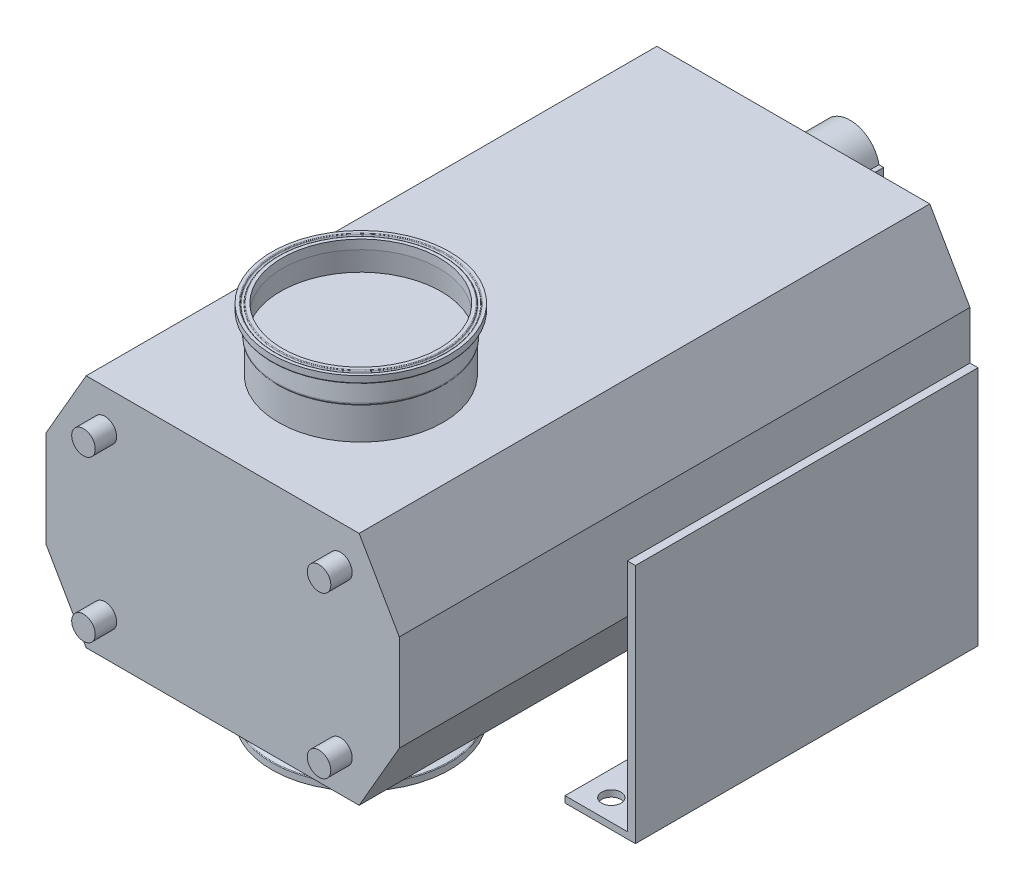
ISO-10303-21;
HEADER;
FILE_DESCRIPTION(('STEP AP214'),'2;1');
FILE_NAME('part.step','',(''),(''),'','','');
FILE_SCHEMA(('AUTOMOTIVE_DESIGN { 1 0 10303 214 1 1 1 1 }'));
ENDSEC;
DATA;
#1=APPLICATION_CONTEXT('core data for automotive mechanical design processes');
#2=APPLICATION_PROTOCOL_DEFINITION('international standard','automotive_design',2000,#1);
#3=PRODUCT_CONTEXT('',#1,'mechanical');
#4=PRODUCT('Part','Part','',(#3));
#5=PRODUCT_RELATED_PRODUCT_CATEGORY('part','',(#4));
#6=PRODUCT_DEFINITION_FORMATION('','',#4);
#7=PRODUCT_DEFINITION_CONTEXT('part definition',#1,'design');
#8=PRODUCT_DEFINITION('design','',#6,#7);
#9=PRODUCT_DEFINITION_SHAPE('','',#8);
#10=(LENGTH_UNIT() NAMED_UNIT(*) SI_UNIT(.MILLI.,.METRE.));
#11=(NAMED_UNIT(*) PLANE_ANGLE_UNIT() SI_UNIT($,.RADIAN.));
#12=(NAMED_UNIT(*) SI_UNIT($,.STERADIAN.) SOLID_ANGLE_UNIT());
#13=UNCERTAINTY_MEASURE_WITH_UNIT(LENGTH_MEASURE(1.E-05),#10,'distance_accuracy_value','');
#14=(GEOMETRIC_REPRESENTATION_CONTEXT(3) GLOBAL_UNCERTAINTY_ASSIGNED_CONTEXT((#13)) GLOBAL_UNIT_ASSIGNED_CONTEXT((#10,
#11,#12)) REPRESENTATION_CONTEXT('',''));
#15=CARTESIAN_POINT('',(0.,0.,0.));
#16=DIRECTION('',(0.,0.,1.));
#17=DIRECTION('',(1.,0.,0.));
#18=AXIS2_PLACEMENT_3D('',#15,#16,#17);
#19=CARTESIAN_POINT('',(-4.0886565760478E-13,141.154700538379,404.));
#20=DIRECTION('',(0.,1.,0.));
#21=DIRECTION('',(-1.,0.,0.));
#22=AXIS2_PLACEMENT_3D('',#19,#20,#21);
#23=CONICAL_SURFACE('',#22,78.0000000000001,1.04719755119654);
#24=CARTESIAN_POINT('',(-4.04893232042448E-13,140.,404.));
#25=DIRECTION('',(0.,-1.,0.));
#26=DIRECTION('',(1.,0.,0.));
#27=AXIS2_PLACEMENT_3D('',#24,#25,#26);
#28=CIRCLE('',#27,76.0000000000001);
#29=CARTESIAN_POINT('',(75.9999999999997,140.,404.));
#30=VERTEX_POINT('',#29);
#31=EDGE_CURVE('P0_E10',#30,#30,#28,.T.);
#32=ORIENTED_EDGE('',*,*,#31,.F.);
#33=EDGE_LOOP('',(#32));
#34=FACE_BOUND('',#33,.T.);
#35=CARTESIAN_POINT('',(-4.0886565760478E-13,141.154700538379,404.));
#36=DIRECTION('',(0.,-1.,0.));
#37=DIRECTION('',(1.,0.,0.));
#38=AXIS2_PLACEMENT_3D('',#35,#36,#37);
#39=CIRCLE('',#38,78.0000000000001);
#40=CARTESIAN_POINT('',(77.9999999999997,141.15470053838,404.));
#41=VERTEX_POINT('',#40);
#42=EDGE_CURVE('P0_E67',#41,#41,#39,.T.);
#43=ORIENTED_EDGE('',*,*,#42,.T.);
#44=EDGE_LOOP('',(#43));
#45=FACE_BOUND('',#44,.T.);
#46=ADVANCED_FACE('P0_F15',(#34,#45),#23,.T.);
#47=CARTESIAN_POINT('',(-76.0000000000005,140.,404.));
#48=DIRECTION('',(0.,1.,0.));
#49=DIRECTION('',(-1.,0.,0.));
#50=AXIS2_PLACEMENT_3D('',#47,#48,#49);
#51=PLANE('',#50);
#52=CARTESIAN_POINT('',(-4.04893232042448E-13,140.,404.));
#53=DIRECTION('',(0.,-1.,0.));
#54=DIRECTION('',(1.,0.,0.));
#55=AXIS2_PLACEMENT_3D('',#52,#53,#54);
#56=CIRCLE('',#55,75.0000000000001);
#57=CARTESIAN_POINT('',(74.9999999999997,140.,404.));
#58=VERTEX_POINT('',#57);
#59=EDGE_CURVE('P0_E21',#58,#58,#56,.T.);
#60=ORIENTED_EDGE('',*,*,#59,.F.);
#61=EDGE_LOOP('',(#60));
#62=FACE_BOUND('',#61,.T.);
#63=ORIENTED_EDGE('',*,*,#31,.T.);
#64=EDGE_LOOP('',(#63));
#65=FACE_BOUND('',#64,.T.);
#66=ADVANCED_FACE('P0_F152',(#62,#65),#51,.F.);
#67=CARTESIAN_POINT('',(-4.04893232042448E-13,140.,404.));
#68=DIRECTION('',(0.,-1.,0.));
#69=DIRECTION('',(1.,0.,0.));
#70=AXIS2_PLACEMENT_3D('',#67,#68,#69);
#71=CONICAL_SURFACE('',#70,75.0000000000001,0.0872664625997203);
#72=CARTESIAN_POINT('',(-4.71740480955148E-13,159.431088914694,404.));
#73=DIRECTION('',(0.,-1.,0.));
#74=DIRECTION('',(1.,0.,0.));
#75=AXIS2_PLACEMENT_3D('',#72,#73,#74);
#76=CIRCLE('',#75,73.3);
#77=CARTESIAN_POINT('',(73.2999999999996,159.431088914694,404.));
#78=VERTEX_POINT('',#77);
#79=EDGE_CURVE('P0_E25',#78,#78,#76,.T.);
#80=ORIENTED_EDGE('',*,*,#79,.F.);
#81=EDGE_LOOP('',(#80));
#82=FACE_BOUND('',#81,.T.);
#83=ORIENTED_EDGE('',*,*,#59,.T.);
#84=EDGE_LOOP('',(#83));
#85=FACE_BOUND('',#84,.T.);
#86=ADVANCED_FACE('P0_F147',(#82,#85),#71,.F.);
#87=CARTESIAN_POINT('',(-3.81484933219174E-13,133.195699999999,404.));
#88=DIRECTION('',(0.,-1.,0.));
#89=DIRECTION('',(1.,0.,0.));
#90=AXIS2_PLACEMENT_3D('',#87,#88,#89);
#91=CYLINDRICAL_SURFACE('',#90,73.3);
#92=CARTESIAN_POINT('',(-5.01219432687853E-13,167.999999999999,404.));
#93=DIRECTION('',(0.,-1.,0.));
#94=DIRECTION('',(1.,0.,0.));
#95=AXIS2_PLACEMENT_3D('',#92,#93,#94);
#96=CIRCLE('',#95,73.3);
#97=CARTESIAN_POINT('',(73.2999999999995,167.999999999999,404.));
#98=VERTEX_POINT('',#97);
#99=EDGE_CURVE('P0_E29',#98,#98,#96,.T.);
#100=ORIENTED_EDGE('',*,*,#99,.F.);
#101=EDGE_LOOP('',(#100));
#102=FACE_BOUND('',#101,.T.);
#103=ORIENTED_EDGE('',*,*,#79,.T.);
#104=EDGE_LOOP('',(#103));
#105=FACE_BOUND('',#104,.T.);
#106=ADVANCED_FACE('P0_F141',(#102,#105),#91,.F.);
#107=CARTESIAN_POINT('',(-73.3000000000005,167.999999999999,404.));
#108=DIRECTION('',(0.,-1.,0.));
#109=DIRECTION('',(1.,0.,0.));
#110=AXIS2_PLACEMENT_3D('',#107,#108,#109);
#111=PLANE('',#110);
#112=CARTESIAN_POINT('',(-5.01219432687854E-13,167.999999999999,404.));
#113=DIRECTION('',(0.,-1.,0.));
#114=DIRECTION('',(1.,0.,0.));
#115=AXIS2_PLACEMENT_3D('',#112,#113,#114);
#116=CIRCLE('',#115,76.2970691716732);
#117=CARTESIAN_POINT('',(76.2970691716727,167.999999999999,404.));
#118=VERTEX_POINT('',#117);
#119=EDGE_CURVE('P0_E34',#118,#118,#116,.T.);
#120=ORIENTED_EDGE('',*,*,#119,.F.);
#121=EDGE_LOOP('',(#120));
#122=FACE_BOUND('',#121,.T.);
#123=ORIENTED_EDGE('',*,*,#99,.T.);
#124=EDGE_LOOP('',(#123));
#125=FACE_BOUND('',#124,.T.);
#126=ADVANCED_FACE('P0_F135',(#122,#125),#111,.F.);
#127=CARTESIAN_POINT('',(-4.85568341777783E-13,167.199999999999,404.));
#128=DIRECTION('',(0.,-1.,0.));
#129=DIRECTION('',(1.,0.,0.));
#130=AXIS2_PLACEMENT_3D('',#127,#128,#129);
#131=TOROIDAL_SURFACE('',#130,76.2970691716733,0.800000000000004);
#132=CARTESIAN_POINT('',(-4.99542616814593E-13,167.512584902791,404.));
#133=DIRECTION('',(0.,-1.,0.));
#134=DIRECTION('',(1.,0.,0.));
#135=AXIS2_PLACEMENT_3D('',#132,#133,#134);
#136=CIRCLE('',#135,77.0334730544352);
#137=CARTESIAN_POINT('',(77.0334730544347,167.512584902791,404.));
#138=VERTEX_POINT('',#137);
#139=EDGE_CURVE('P0_E37',#138,#138,#136,.T.);
#140=ORIENTED_EDGE('',*,*,#139,.F.);
#141=EDGE_LOOP('',(#140));
#142=FACE_BOUND('',#141,.T.);
#143=ORIENTED_EDGE('',*,*,#119,.T.);
#144=EDGE_LOOP('',(#143));
#145=FACE_BOUND('',#144,.T.);
#146=ADVANCED_FACE('P0_F129',(#142,#145),#131,.T.);
#147=CARTESIAN_POINT('',(-4.99542616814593E-13,167.512584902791,404.));
#148=DIRECTION('',(0.,-1.,0.));
#149=DIRECTION('',(1.,0.,0.));
#150=AXIS2_PLACEMENT_3D('',#147,#148,#149);
#151=CONICAL_SURFACE('',#150,77.0334730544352,0.40142572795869);
#152=CARTESIAN_POINT('',(-4.98230302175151E-13,167.131122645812,404.));
#153=DIRECTION('',(0.,-1.,0.));
#154=DIRECTION('',(1.,0.,0.));
#155=AXIS2_PLACEMENT_3D('',#152,#153,#154);
#156=CIRCLE('',#155,77.1953941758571);
#157=CARTESIAN_POINT('',(77.1953941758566,167.131122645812,404.));
#158=VERTEX_POINT('',#157);
#159=EDGE_CURVE('P0_E40',#158,#158,#156,.T.);
#160=ORIENTED_EDGE('',*,*,#159,.F.);
#161=EDGE_LOOP('',(#160));
#162=FACE_BOUND('',#161,.T.);
#163=ORIENTED_EDGE('',*,*,#139,.T.);
#164=EDGE_LOOP('',(#163));
#165=FACE_BOUND('',#164,.T.);
#166=ADVANCED_FACE('P0_F123',(#162,#165),#151,.T.);
#167=CARTESIAN_POINT('',(-4.99446129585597E-13,167.599999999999,404.));
#168=DIRECTION('',(0.,-1.,0.));
#169=DIRECTION('',(1.,0.,0.));
#170=AXIS2_PLACEMENT_3D('',#167,#168,#169);
#171=TOROIDAL_SURFACE('',#170,78.3,1.20000000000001);
#172=CARTESIAN_POINT('',(-4.98230302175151E-13,167.131122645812,404.));
#173=DIRECTION('',(0.,-1.,0.));
#174=DIRECTION('',(1.,0.,0.));
#175=AXIS2_PLACEMENT_3D('',#172,#173,#174);
#176=CIRCLE('',#175,79.4046058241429);
#177=CARTESIAN_POINT('',(79.4046058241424,167.131122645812,404.));
#178=VERTEX_POINT('',#177);
#179=EDGE_CURVE('P0_E43',#178,#178,#176,.T.);
#180=ORIENTED_EDGE('',*,*,#179,.F.);
#181=EDGE_LOOP('',(#180));
#182=FACE_BOUND('',#181,.T.);
#183=ORIENTED_EDGE('',*,*,#159,.T.);
#184=EDGE_LOOP('',(#183));
#185=FACE_BOUND('',#184,.T.);
#186=ADVANCED_FACE('P0_F117',(#182,#185),#171,.F.);
#187=CARTESIAN_POINT('',(-4.98230302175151E-13,167.131122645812,404.));
#188=DIRECTION('',(0.,1.,0.));
#189=DIRECTION('',(-1.,0.,0.));
#190=AXIS2_PLACEMENT_3D('',#187,#188,#189);
#191=CONICAL_SURFACE('',#190,79.4046058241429,0.40142572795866);
#192=CARTESIAN_POINT('',(-4.99542616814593E-13,167.512584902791,404.));
#193=DIRECTION('',(0.,-1.,0.));
#194=DIRECTION('',(1.,0.,0.));
#195=AXIS2_PLACEMENT_3D('',#192,#193,#194);
#196=CIRCLE('',#195,79.5665269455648);
#197=CARTESIAN_POINT('',(79.5665269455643,167.512584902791,404.));
#198=VERTEX_POINT('',#197);
#199=EDGE_CURVE('P0_E46',#198,#198,#196,.T.);
#200=ORIENTED_EDGE('',*,*,#199,.F.);
#201=EDGE_LOOP('',(#200));
#202=FACE_BOUND('',#201,.T.);
#203=ORIENTED_EDGE('',*,*,#179,.T.);
#204=EDGE_LOOP('',(#203));
#205=FACE_BOUND('',#204,.T.);
#206=ADVANCED_FACE('P0_F111',(#202,#205),#191,.F.);
#207=CARTESIAN_POINT('',(-4.85568341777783E-13,167.199999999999,404.));
#208=DIRECTION('',(0.,-1.,0.));
#209=DIRECTION('',(1.,0.,0.));
#210=AXIS2_PLACEMENT_3D('',#207,#208,#209);
#211=TOROIDAL_SURFACE('',#210,80.3029308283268,0.800000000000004);
#212=CARTESIAN_POINT('',(-5.01219432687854E-13,167.999999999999,404.));
#213=DIRECTION('',(0.,-1.,0.));
#214=DIRECTION('',(1.,0.,0.));
#215=AXIS2_PLACEMENT_3D('',#212,#213,#214);
#216=CIRCLE('',#215,80.3029308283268);
#217=CARTESIAN_POINT('',(80.3029308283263,167.999999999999,404.));
#218=VERTEX_POINT('',#217);
#219=EDGE_CURVE('P0_E49',#218,#218,#216,.T.);
#220=ORIENTED_EDGE('',*,*,#219,.F.);
#221=EDGE_LOOP('',(#220));
#222=FACE_BOUND('',#221,.T.);
#223=ORIENTED_EDGE('',*,*,#199,.T.);
#224=EDGE_LOOP('',(#223));
#225=FACE_BOUND('',#224,.T.);
#226=ADVANCED_FACE('P0_F105',(#222,#225),#211,.T.);
#227=CARTESIAN_POINT('',(-80.3029308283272,167.999999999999,404.));
#228=DIRECTION('',(0.,-1.,0.));
#229=DIRECTION('',(1.,0.,0.));
#230=AXIS2_PLACEMENT_3D('',#227,#228,#229);
#231=PLANE('',#230);
#232=CARTESIAN_POINT('',(-5.01219432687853E-13,167.999999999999,404.));
#233=DIRECTION('',(0.,-1.,0.));
#234=DIRECTION('',(1.,0.,0.));
#235=AXIS2_PLACEMENT_3D('',#232,#233,#234);
#236=CIRCLE('',#235,83.1);
#237=CARTESIAN_POINT('',(83.0999999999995,167.999999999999,404.));
#238=VERTEX_POINT('',#237);
#239=EDGE_CURVE('P0_E52',#238,#238,#236,.T.);
#240=ORIENTED_EDGE('',*,*,#239,.F.);
#241=EDGE_LOOP('',(#240));
#242=FACE_BOUND('',#241,.T.);
#243=ORIENTED_EDGE('',*,*,#219,.T.);
#244=EDGE_LOOP('',(#243));
#245=FACE_BOUND('',#244,.T.);
#246=ADVANCED_FACE('P0_F99',(#242,#245),#231,.F.);
#247=CARTESIAN_POINT('',(-3.81484933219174E-13,133.195699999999,404.));
#248=DIRECTION('',(0.,-1.,0.));
#249=DIRECTION('',(1.,0.,0.));
#250=AXIS2_PLACEMENT_3D('',#247,#248,#249);
#251=CYLINDRICAL_SURFACE('',#250,83.1);
#252=CARTESIAN_POINT('',(-4.81480713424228E-13,162.262369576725,404.));
#253=DIRECTION('',(0.,-1.,0.));
#254=DIRECTION('',(1.,0.,0.));
#255=AXIS2_PLACEMENT_3D('',#252,#253,#254);
#256=CIRCLE('',#255,83.1);
#257=CARTESIAN_POINT('',(83.0999999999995,162.262369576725,404.));
#258=VERTEX_POINT('',#257);
#259=EDGE_CURVE('P0_E55',#258,#258,#256,.T.);
#260=ORIENTED_EDGE('',*,*,#259,.F.);
#261=EDGE_LOOP('',(#260));
#262=FACE_BOUND('',#261,.T.);
#263=ORIENTED_EDGE('',*,*,#239,.T.);
#264=EDGE_LOOP('',(#263));
#265=FACE_BOUND('',#264,.T.);
#266=ADVANCED_FACE('P0_F93',(#262,#265),#251,.T.);
#267=CARTESIAN_POINT('',(-4.85568341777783E-13,162.262369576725,404.));
#268=DIRECTION('',(0.,-1.,0.));
#269=DIRECTION('',(1.,0.,0.));
#270=AXIS2_PLACEMENT_3D('',#267,#268,#269);
#271=TOROIDAL_SURFACE('',#270,82.3,0.799999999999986);
#272=CARTESIAN_POINT('',(-4.78894512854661E-13,161.510615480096,404.));
#273=DIRECTION('',(0.,-1.,0.));
#274=DIRECTION('',(1.,0.,0.));
#275=AXIS2_PLACEMENT_3D('',#272,#273,#274);
#276=CIRCLE('',#275,82.5736161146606);
#277=CARTESIAN_POINT('',(82.5736161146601,161.510615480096,404.));
#278=VERTEX_POINT('',#277);
#279=EDGE_CURVE('P0_E58',#278,#278,#276,.T.);
#280=ORIENTED_EDGE('',*,*,#279,.F.);
#281=EDGE_LOOP('',(#280));
#282=FACE_BOUND('',#281,.T.);
#283=ORIENTED_EDGE('',*,*,#259,.T.);
#284=EDGE_LOOP('',(#283));
#285=FACE_BOUND('',#284,.T.);
#286=ADVANCED_FACE('P0_F87',(#282,#285),#271,.T.);
#287=CARTESIAN_POINT('',(-4.78894512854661E-13,161.510615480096,404.));
#288=DIRECTION('',(0.,1.,0.));
#289=DIRECTION('',(-1.,0.,0.));
#290=AXIS2_PLACEMENT_3D('',#287,#288,#289);
#291=CONICAL_SURFACE('',#290,82.5736161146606,1.22173047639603);
#292=CARTESIAN_POINT('',(-4.71289506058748E-13,159.3,404.));
#293=DIRECTION('',(0.,-1.,0.));
#294=DIRECTION('',(1.,0.,0.));
#295=AXIS2_PLACEMENT_3D('',#292,#293,#294);
#296=CIRCLE('',#295,76.5);
#297=CARTESIAN_POINT('',(76.4999999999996,159.3,404.));
#298=VERTEX_POINT('',#297);
#299=EDGE_CURVE('P0_E61',#298,#298,#296,.T.);
#300=ORIENTED_EDGE('',*,*,#299,.F.);
#301=EDGE_LOOP('',(#300));
#302=FACE_BOUND('',#301,.T.);
#303=ORIENTED_EDGE('',*,*,#279,.T.);
#304=EDGE_LOOP('',(#303));
#305=FACE_BOUND('',#304,.T.);
#306=ADVANCED_FACE('P0_F81',(#302,#305),#291,.T.);
#307=CARTESIAN_POINT('',(-4.71289506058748E-13,159.3,404.));
#308=DIRECTION('',(0.,-1.,0.));
#309=DIRECTION('',(1.,0.,0.));
#310=AXIS2_PLACEMENT_3D('',#307,#308,#309);
#311=CONICAL_SURFACE('',#310,76.5,0.0872664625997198);
#312=CARTESIAN_POINT('',(-4.12306639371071E-13,142.154921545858,404.));
#313=DIRECTION('',(0.,-1.,0.));
#314=DIRECTION('',(1.,0.,0.));
#315=AXIS2_PLACEMENT_3D('',#312,#313,#314);
#316=CIRCLE('',#315,78.0000000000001);
#317=CARTESIAN_POINT('',(77.9999999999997,142.154921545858,404.));
#318=VERTEX_POINT('',#317);
#319=EDGE_CURVE('P0_E64',#318,#318,#316,.T.);
#320=ORIENTED_EDGE('',*,*,#319,.F.);
#321=EDGE_LOOP('',(#320));
#322=FACE_BOUND('',#321,.T.);
#323=ORIENTED_EDGE('',*,*,#299,.T.);
#324=EDGE_LOOP('',(#323));
#325=FACE_BOUND('',#324,.T.);
#326=ADVANCED_FACE('P0_F75',(#322,#325),#311,.T.);
#327=CARTESIAN_POINT('',(-3.81484933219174E-13,133.195699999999,404.));
#328=DIRECTION('',(0.,-1.,0.));
#329=DIRECTION('',(1.,0.,0.));
#330=AXIS2_PLACEMENT_3D('',#327,#328,#329);
#331=CYLINDRICAL_SURFACE('',#330,78.0000000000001);
#332=ORIENTED_EDGE('',*,*,#42,.F.);
#333=EDGE_LOOP('',(#332));
#334=FACE_BOUND('',#333,.T.);
#335=ORIENTED_EDGE('',*,*,#319,.T.);
#336=EDGE_LOOP('',(#335));
#337=FACE_BOUND('',#336,.T.);
#338=ADVANCED_FACE('P0_F72',(#334,#337),#331,.T.);
#339=CLOSED_SHELL('',(#46,#66,#86,#106,#126,#146,#166,#186,#206,#226,#246,#266,#286,#306,#326,#338));
#340=MANIFOLD_SOLID_BREP('P0_B1',#339);
#341=CARTESIAN_POINT('',(-106.773910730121,-225.,320.));
#342=DIRECTION('',(0.,1.,0.));
#343=DIRECTION('',(0.,0.,1.));
#344=AXIS2_PLACEMENT_3D('',#341,#342,#343);
#345=PLANE('',#344);
#346=CARTESIAN_POINT('',(-130.,-225.,300.));
#347=DIRECTION('',(0.,1.,0.));
#348=DIRECTION('',(0.,0.,-1.));
#349=AXIS2_PLACEMENT_3D('',#346,#347,#348);
#350=CIRCLE('',#349,9.00000000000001);
#351=CARTESIAN_POINT('',(-130.,-225.,291.));
#352=VERTEX_POINT('',#351);
#353=EDGE_CURVE('P1_E575',#352,#352,#350,.T.);
#354=ORIENTED_EDGE('',*,*,#353,.T.);
#355=EDGE_LOOP('',(#354));
#356=FACE_BOUND('',#355,.T.);
#357=DIRECTION('',(1.,0.,0.));
#358=VECTOR('',#357,1.);
#359=CARTESIAN_POINT('',(-106.773910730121,-225.,0.));
#360=LINE('',#359,#358);
#361=CARTESIAN_POINT('',(-172.5,-225.,0.));
#362=VERTEX_POINT('',#361);
#363=CARTESIAN_POINT('',(-106.773910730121,-225.,0.));
#364=VERTEX_POINT('',#363);
#365=EDGE_CURVE('P1_E586',#362,#364,#360,.T.);
#366=ORIENTED_EDGE('',*,*,#365,.T.);
#367=DIRECTION('',(0.,0.,-1.));
#368=VECTOR('',#367,1.);
#369=CARTESIAN_POINT('',(-106.773910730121,-225.,320.));
#370=LINE('',#369,#368);
#371=CARTESIAN_POINT('',(-106.773910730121,-225.,320.));
#372=VERTEX_POINT('',#371);
#373=EDGE_CURVE('P1_E593',#372,#364,#370,.T.);
#374=ORIENTED_EDGE('',*,*,#373,.F.);
#375=DIRECTION('',(1.,0.,0.));
#376=VECTOR('',#375,1.);
#377=CARTESIAN_POINT('',(-106.773910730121,-225.,320.));
#378=LINE('',#377,#376);
#379=CARTESIAN_POINT('',(-172.5,-225.,320.));
#380=VERTEX_POINT('',#379);
#381=EDGE_CURVE('P1_E217',#380,#372,#378,.T.);
#382=ORIENTED_EDGE('',*,*,#381,.F.);
#383=DIRECTION('',(0.,0.,-1.));
#384=VECTOR('',#383,1.);
#385=CARTESIAN_POINT('',(-172.5,-225.,320.));
#386=LINE('',#385,#384);
#387=EDGE_CURVE('P1_E590',#380,#362,#386,.T.);
#388=ORIENTED_EDGE('',*,*,#387,.T.);
#389=EDGE_LOOP('',(#366,#374,#382,#388));
#390=FACE_BOUND('',#389,.T.);
#391=CARTESIAN_POINT('',(-130.,-225.,20.));
#392=DIRECTION('',(0.,1.,0.));
#393=DIRECTION('',(0.,0.,-1.));
#394=AXIS2_PLACEMENT_3D('',#391,#392,#393);
#395=CIRCLE('',#394,9.00000000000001);
#396=CARTESIAN_POINT('',(-130.,-225.,11.));
#397=VERTEX_POINT('',#396);
#398=EDGE_CURVE('P1_E883',#397,#397,#395,.T.);
#399=ORIENTED_EDGE('',*,*,#398,.T.);
#400=EDGE_LOOP('',(#399));
#401=FACE_BOUND('',#400,.T.);
#402=ADVANCED_FACE('P1_F17',(#356,#390,#401),#345,.F.);
#403=CARTESIAN_POINT('',(-165.,-219.,320.));
#404=DIRECTION('',(0.,-1.,0.));
#405=DIRECTION('',(0.,0.,-1.));
#406=AXIS2_PLACEMENT_3D('',#403,#404,#405);
#407=PLANE('',#406);
#408=CARTESIAN_POINT('',(-130.,-219.,300.));
#409=DIRECTION('',(0.,-1.,0.));
#410=DIRECTION('',(0.,0.,-1.));
#411=AXIS2_PLACEMENT_3D('',#408,#409,#410);
#412=CIRCLE('',#411,9.00000000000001);
#413=CARTESIAN_POINT('',(-130.,-219.,291.));
#414=VERTEX_POINT('',#413);
#415=EDGE_CURVE('P1_E579',#414,#414,#412,.T.);
#416=ORIENTED_EDGE('',*,*,#415,.T.);
#417=EDGE_LOOP('',(#416));
#418=FACE_BOUND('',#417,.T.);
#419=DIRECTION('',(-1.,0.,0.));
#420=VECTOR('',#419,1.);
#421=CARTESIAN_POINT('',(-165.,-219.,0.));
#422=LINE('',#421,#420);
#423=CARTESIAN_POINT('',(-106.773910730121,-219.,0.));
#424=VERTEX_POINT('',#423);
#425=CARTESIAN_POINT('',(-165.,-219.,0.));
#426=VERTEX_POINT('',#425);
#427=EDGE_CURVE('P1_E577',#424,#426,#422,.T.);
#428=ORIENTED_EDGE('',*,*,#427,.T.);
#429=DIRECTION('',(0.,0.,-1.));
#430=VECTOR('',#429,1.);
#431=CARTESIAN_POINT('',(-165.,-219.,320.));
#432=LINE('',#431,#430);
#433=CARTESIAN_POINT('',(-165.,-219.,320.));
#434=VERTEX_POINT('',#433);
#435=EDGE_CURVE('P1_E211',#434,#426,#432,.T.);
#436=ORIENTED_EDGE('',*,*,#435,.F.);
#437=DIRECTION('',(-1.,0.,0.));
#438=VECTOR('',#437,1.);
#439=CARTESIAN_POINT('',(-165.,-219.,320.));
#440=LINE('',#439,#438);
#441=CARTESIAN_POINT('',(-106.773910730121,-219.,320.));
#442=VERTEX_POINT('',#441);
#443=EDGE_CURVE('P1_E602',#442,#434,#440,.T.);
#444=ORIENTED_EDGE('',*,*,#443,.F.);
#445=DIRECTION('',(0.,0.,-1.));
#446=VECTOR('',#445,1.);
#447=CARTESIAN_POINT('',(-106.773910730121,-219.,320.));
#448=LINE('',#447,#446);
#449=EDGE_CURVE('P1_E215',#442,#424,#448,.T.);
#450=ORIENTED_EDGE('',*,*,#449,.T.);
#451=EDGE_LOOP('',(#428,#436,#444,#450));
#452=FACE_BOUND('',#451,.T.);
#453=CARTESIAN_POINT('',(-130.,-219.,20.));
#454=DIRECTION('',(0.,-1.,0.));
#455=DIRECTION('',(0.,0.,-1.));
#456=AXIS2_PLACEMENT_3D('',#453,#454,#455);
#457=CIRCLE('',#456,9.00000000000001);
#458=CARTESIAN_POINT('',(-130.,-219.,11.));
#459=VERTEX_POINT('',#458);
#460=EDGE_CURVE('P1_E886',#459,#459,#457,.T.);
#461=ORIENTED_EDGE('',*,*,#460,.T.);
#462=EDGE_LOOP('',(#461));
#463=FACE_BOUND('',#462,.T.);
#464=ADVANCED_FACE('P1_F455',(#418,#452,#463),#407,.F.);
#465=CARTESIAN_POINT('',(-165.,45.,533.));
#466=DIRECTION('',(1.,0.,0.));
#467=DIRECTION('',(0.,0.,-1.));
#468=AXIS2_PLACEMENT_3D('',#465,#466,#467);
#469=PLANE('',#468);
#470=DIRECTION('',(0.,0.,-1.));
#471=VECTOR('',#470,1.);
#472=CARTESIAN_POINT('',(-165.,0.,320.));
#473=LINE('',#472,#471);
#474=CARTESIAN_POINT('',(-165.,0.,320.));
#475=VERTEX_POINT('',#474);
#476=CARTESIAN_POINT('',(-165.,0.,0.));
#477=VERTEX_POINT('',#476);
#478=EDGE_CURVE('P1_E200',#475,#477,#473,.T.);
#479=ORIENTED_EDGE('',*,*,#478,.F.);
#480=DIRECTION('',(0.,1.,0.));
#481=VECTOR('',#480,1.);
#482=CARTESIAN_POINT('',(-165.,0.,320.));
#483=LINE('',#482,#481);
#484=CARTESIAN_POINT('',(-165.,-44.9999999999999,320.));
#485=VERTEX_POINT('',#484);
#486=EDGE_CURVE('P1_E185',#485,#475,#483,.T.);
#487=ORIENTED_EDGE('',*,*,#486,.F.);
#488=DIRECTION('',(0.,0.,-1.));
#489=VECTOR('',#488,1.);
#490=CARTESIAN_POINT('',(-165.,-45.,533.));
#491=LINE('',#490,#489);
#492=CARTESIAN_POINT('',(-165.,-45.,533.));
#493=VERTEX_POINT('',#492);
#494=EDGE_CURVE('P1_E395',#493,#485,#491,.T.);
#495=ORIENTED_EDGE('',*,*,#494,.F.);
#496=DIRECTION('',(0.,-1.,0.));
#497=VECTOR('',#496,1.);
#498=CARTESIAN_POINT('',(-165.,45.,533.));
#499=LINE('',#498,#497);
#500=CARTESIAN_POINT('',(-165.,45.,533.));
#501=VERTEX_POINT('',#500);
#502=EDGE_CURVE('P1_E359',#501,#493,#499,.T.);
#503=ORIENTED_EDGE('',*,*,#502,.F.);
#504=DIRECTION('',(0.,0.,-1.));
#505=VECTOR('',#504,1.);
#506=CARTESIAN_POINT('',(-165.,45.,533.));
#507=LINE('',#506,#505);
#508=CARTESIAN_POINT('',(-165.,45.,0.));
#509=VERTEX_POINT('',#508);
#510=EDGE_CURVE('P1_E397',#501,#509,#507,.T.);
#511=ORIENTED_EDGE('',*,*,#510,.T.);
#512=DIRECTION('',(0.,-1.,0.));
#513=VECTOR('',#512,1.);
#514=CARTESIAN_POINT('',(-165.,45.,0.));
#515=LINE('',#514,#513);
#516=EDGE_CURVE('P1_E210',#509,#477,#515,.T.);
#517=ORIENTED_EDGE('',*,*,#516,.T.);
#518=EDGE_LOOP('',(#479,#487,#495,#503,#511,#517));
#519=FACE_BOUND('',#518,.T.);
#520=ADVANCED_FACE('P1_F207',(#519),#469,.F.);
#521=CARTESIAN_POINT('',(-60.,0.,241.732657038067));
#522=DIRECTION('',(0.,0.,1.));
#523=DIRECTION('',(1.,0.,0.));
#524=AXIS2_PLACEMENT_3D('',#521,#522,#523);
#525=CYLINDRICAL_SURFACE('',#524,27.5);
#526=CARTESIAN_POINT('',(-60.,0.,-3.));
#527=DIRECTION('',(0.,0.,1.));
#528=DIRECTION('',(1.,0.,0.));
#529=AXIS2_PLACEMENT_3D('',#526,#527,#528);
#530=CIRCLE('',#529,27.5);
#531=CARTESIAN_POINT('',(-32.5,0.,-3.));
#532=VERTEX_POINT('',#531);
#533=EDGE_CURVE('P1_E320',#532,#532,#530,.T.);
#534=ORIENTED_EDGE('',*,*,#533,.F.);
#535=EDGE_LOOP('',(#534));
#536=FACE_BOUND('',#535,.T.);
#537=DIRECTION('',(0.,0.,1.));
#538=VECTOR('',#537,1.);
#539=CARTESIAN_POINT('',(-32.9583654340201,4.99999999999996,241.732657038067));
#540=LINE('',#539,#538);
#541=CARTESIAN_POINT('',(-32.9583654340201,5.00000000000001,-113.));
#542=VERTEX_POINT('',#541);
#543=CARTESIAN_POINT('',(-32.9583654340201,5.,-63.));
#544=VERTEX_POINT('',#543);
#545=EDGE_CURVE('P1_E305',#542,#544,#540,.T.);
#546=ORIENTED_EDGE('',*,*,#545,.F.);
#547=CARTESIAN_POINT('',(-60.,0.,-113.));
#548=DIRECTION('',(0.,0.,1.));
#549=DIRECTION('',(1.,0.,0.));
#550=AXIS2_PLACEMENT_3D('',#547,#548,#549);
#551=CIRCLE('',#550,27.5);
#552=CARTESIAN_POINT('',(-32.9583654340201,-4.99999999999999,-113.));
#553=VERTEX_POINT('',#552);
#554=EDGE_CURVE('P1_E318',#542,#553,#551,.T.);
#555=ORIENTED_EDGE('',*,*,#554,.T.);
#556=DIRECTION('',(0.,0.,1.));
#557=VECTOR('',#556,1.);
#558=CARTESIAN_POINT('',(-32.9583654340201,-5.00000000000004,241.732657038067));
#559=LINE('',#558,#557);
#560=CARTESIAN_POINT('',(-32.9583654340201,-5.00000000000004,-62.9999999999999));
#561=VERTEX_POINT('',#560);
#562=EDGE_CURVE('P1_E302',#561,#553,#559,.F.);
#563=ORIENTED_EDGE('',*,*,#562,.F.);
#564=CARTESIAN_POINT('',(-32.5,0.,-68.));
#565=CARTESIAN_POINT('',(-32.4999988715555,0.139243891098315,-68.0000024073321));
#566=CARTESIAN_POINT('',(-32.5010594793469,0.278456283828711,-67.9941816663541));
#567=CARTESIAN_POINT('',(-32.5052698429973,0.555920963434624,-67.9709482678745));
#568=CARTESIAN_POINT('',(-32.5084199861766,0.69417306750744,-67.9535334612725));
#569=CARTESIAN_POINT('',(-32.5167252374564,0.968758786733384,-67.9072300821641));
#570=CARTESIAN_POINT('',(-32.5218815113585,1.10509123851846,-67.8783348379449));
#571=CARTESIAN_POINT('',(-32.5340566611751,1.37484220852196,-67.809282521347));
#572=CARTESIAN_POINT('',(-32.5410762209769,1.50825963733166,-67.7691213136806));
#573=CARTESIAN_POINT('',(-32.5567718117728,1.77102525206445,-67.6779041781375));
#574=CARTESIAN_POINT('',(-32.5654457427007,1.90037835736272,-67.6268620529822));
#575=CARTESIAN_POINT('',(-32.5842196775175,2.15434684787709,-67.5142102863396));
#576=CARTESIAN_POINT('',(-32.5943202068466,2.27896046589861,-67.4525967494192));
#577=CARTESIAN_POINT('',(-32.6156621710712,2.52249441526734,-67.3192919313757));
#578=CARTESIAN_POINT('',(-32.6269030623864,2.64141741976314,-67.2476054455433));
#579=CARTESIAN_POINT('',(-32.6502265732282,2.87287846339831,-67.0946089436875));
#580=CARTESIAN_POINT('',(-32.6623095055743,2.98541410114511,-67.0132953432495));
#581=CARTESIAN_POINT('',(-32.6871037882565,3.20436568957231,-66.8407881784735));
#582=CARTESIAN_POINT('',(-32.6998201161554,3.31071129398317,-66.7495060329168));
#583=CARTESIAN_POINT('',(-32.7254213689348,3.51539543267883,-66.5583162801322));
#584=CARTESIAN_POINT('',(-32.7383063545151,3.61373098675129,-66.458405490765));
#585=CARTESIAN_POINT('',(-32.7638763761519,3.80165254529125,-66.2506992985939));
#586=CARTESIAN_POINT('',(-32.7765614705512,3.89124114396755,-66.1429062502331));
#587=CARTESIAN_POINT('',(-32.8013837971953,4.06111440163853,-65.9200997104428));
#588=CARTESIAN_POINT('',(-32.8135208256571,4.14139561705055,-65.8050835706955));
#589=CARTESIAN_POINT('',(-32.8369804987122,4.29258292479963,-65.5678120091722));
#590=CARTESIAN_POINT('',(-32.8482967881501,4.36341882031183,-65.4455112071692));
#591=CARTESIAN_POINT('',(-32.869695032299,4.4945486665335,-65.1952227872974));
#592=CARTESIAN_POINT('',(-32.8797765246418,4.55483867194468,-65.0672330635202));
#593=CARTESIAN_POINT('',(-32.8983991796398,4.66436791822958,-64.8065544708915));
#594=CARTESIAN_POINT('',(-32.9069410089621,4.71361194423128,-64.6738676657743));
#595=CARTESIAN_POINT('',(-32.922240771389,4.8007169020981,-64.4046947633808));
#596=CARTESIAN_POINT('',(-32.9289980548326,4.83857368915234,-64.2682073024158));
#597=CARTESIAN_POINT('',(-32.9461329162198,4.93382551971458,-63.8576226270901));
#598=CARTESIAN_POINT('',(-32.9536068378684,4.97422708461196,-63.579236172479));
#599=CARTESIAN_POINT('',(-32.9598077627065,5.00782079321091,-63.0196963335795));
#600=CARTESIAN_POINT('',(-32.9585355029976,5.00101691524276,-62.7385431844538));
#601=CARTESIAN_POINT('',(-32.9474824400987,4.94086952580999,-62.1849314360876));
#602=CARTESIAN_POINT('',(-32.9378069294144,4.88810191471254,-61.9124083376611));
#603=CARTESIAN_POINT('',(-32.9111987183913,4.73841411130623,-61.3801594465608));
#604=CARTESIAN_POINT('',(-32.8942657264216,4.64149214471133,-61.120434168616));
#605=CARTESIAN_POINT('',(-32.854940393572,4.40568216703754,-60.619443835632));
#606=CARTESIAN_POINT('',(-32.8325176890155,4.26655968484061,-60.3782916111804));
#607=CARTESIAN_POINT('',(-32.7847594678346,3.95046265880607,-59.9225379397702));
#608=CARTESIAN_POINT('',(-32.7594236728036,3.7734844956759,-59.7079390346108));
#609=CARTESIAN_POINT('',(-32.7082339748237,3.38358496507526,-59.3080525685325));
#610=CARTESIAN_POINT('',(-32.6823779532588,3.17017042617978,-59.1232457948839));
#611=CARTESIAN_POINT('',(-32.6334062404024,2.71511135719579,-58.7919871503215));
#612=CARTESIAN_POINT('',(-32.6102905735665,2.4734665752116,-58.6455356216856));
#613=CARTESIAN_POINT('',(-32.5693615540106,1.96831899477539,-58.3950815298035));
#614=CARTESIAN_POINT('',(-32.5515541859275,1.70479195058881,-58.2911268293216));
#615=CARTESIAN_POINT('',(-32.5232948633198,1.16362103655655,-58.1290920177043));
#616=CARTESIAN_POINT('',(-32.5128421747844,0.885978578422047,-58.0710073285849));
#617=CARTESIAN_POINT('',(-32.5005701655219,0.328596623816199,-58.0030255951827));
#618=CARTESIAN_POINT('',(-32.4986327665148,0.0489400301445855,-57.9924694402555));
#619=CARTESIAN_POINT('',(-32.5032842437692,-0.508143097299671,-58.018079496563));
#620=CARTESIAN_POINT('',(-32.5098727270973,-0.785569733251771,-58.0542435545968));
#621=CARTESIAN_POINT('',(-32.5307622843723,-1.32824274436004,-58.1717193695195));
#622=CARTESIAN_POINT('',(-32.5450067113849,-1.59356324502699,-58.2526996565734));
#623=CARTESIAN_POINT('',(-32.5796176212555,-2.10686178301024,-58.4571520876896));
#624=CARTESIAN_POINT('',(-32.5999845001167,-2.35483869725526,-58.5806269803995));
#625=CARTESIAN_POINT('',(-32.644875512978,-2.82923812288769,-58.8680365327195));
#626=CARTESIAN_POINT('',(-32.6694404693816,-3.05541114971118,-59.0323764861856));
#627=CARTESIAN_POINT('',(-32.7198927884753,-3.47720532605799,-59.3963011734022));
#628=CARTESIAN_POINT('',(-32.7457802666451,-3.67282380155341,-59.5958889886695));
#629=CARTESIAN_POINT('',(-32.796349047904,-4.03044352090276,-60.0276163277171));
#630=CARTESIAN_POINT('',(-32.8210113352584,-4.19199619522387,-60.2601299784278));
#631=CARTESIAN_POINT('',(-32.8659621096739,-4.47374938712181,-60.7493937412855));
#632=CARTESIAN_POINT('',(-32.8862507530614,-4.59395138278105,-61.0061429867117));
#633=CARTESIAN_POINT('',(-32.9200118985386,-4.78894965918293,-61.5353646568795));
#634=CARTESIAN_POINT('',(-32.933515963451,-4.86395652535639,-61.80775757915));
#635=CARTESIAN_POINT('',(-32.9522449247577,-4.96707217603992,-62.3617029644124));
#636=CARTESIAN_POINT('',(-32.9574706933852,-4.99518590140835,-62.6432544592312));
#637=CARTESIAN_POINT('',(-32.9586508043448,-5.00153102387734,-63.0637361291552));
#638=CARTESIAN_POINT('',(-32.9579621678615,-4.99782447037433,-63.2026140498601));
#639=CARTESIAN_POINT('',(-32.9544668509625,-4.97888166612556,-63.4795403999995));
#640=CARTESIAN_POINT('',(-32.9516609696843,-4.96364976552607,-63.6175891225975));
#641=CARTESIAN_POINT('',(-32.9440080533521,-4.92176219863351,-63.8919241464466));
#642=CARTESIAN_POINT('',(-32.9391602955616,-4.89510248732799,-64.0282098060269));
#643=CARTESIAN_POINT('',(-32.9275679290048,-4.83057933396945,-64.2979701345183));
#644=CARTESIAN_POINT('',(-32.9208240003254,-4.79271990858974,-64.4314457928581));
#645=CARTESIAN_POINT('',(-32.905642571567,-4.70613665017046,-64.6945299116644));
#646=CARTESIAN_POINT('',(-32.8972073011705,-4.65742711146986,-64.8241432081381));
#647=CARTESIAN_POINT('',(-32.8788810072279,-4.54949424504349,-65.0787530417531));
#648=CARTESIAN_POINT('',(-32.868990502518,-4.49027466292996,-65.2037512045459));
#649=CARTESIAN_POINT('',(-32.8480252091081,-4.36170911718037,-65.4483862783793));
#650=CARTESIAN_POINT('',(-32.836949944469,-4.29235907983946,-65.568021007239));
#651=CARTESIAN_POINT('',(-32.8139305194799,-4.1440622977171,-65.8010379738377));
#652=CARTESIAN_POINT('',(-32.8019866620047,-4.06511889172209,-65.9144223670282));
#653=CARTESIAN_POINT('',(-32.7773783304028,-3.8969465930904,-66.1358269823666));
#654=CARTESIAN_POINT('',(-32.7647059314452,-3.80758543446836,-66.2437458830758));
#655=CARTESIAN_POINT('',(-32.7391619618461,-3.62017233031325,-66.4516566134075));
#656=CARTESIAN_POINT('',(-32.7262904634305,-3.52212347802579,-66.5516512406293));
#657=CARTESIAN_POINT('',(-32.700695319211,-3.31791447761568,-66.743133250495));
#658=CARTESIAN_POINT('',(-32.6879717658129,-3.21174954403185,-66.8346155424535));
#659=CARTESIAN_POINT('',(-32.6630392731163,-2.99212066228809,-67.0083427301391));
#660=CARTESIAN_POINT('',(-32.6508301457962,-2.87865941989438,-67.0905910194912));
#661=CARTESIAN_POINT('',(-32.6271575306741,-2.64414496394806,-67.2459930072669));
#662=CARTESIAN_POINT('',(-32.6157015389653,-2.52303379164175,-67.3190604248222));
#663=CARTESIAN_POINT('',(-32.5939830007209,-2.27502120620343,-67.4546883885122));
#664=CARTESIAN_POINT('',(-32.5837200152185,-2.14812194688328,-67.5172528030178));
#665=CARTESIAN_POINT('',(-32.5646811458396,-1.8894645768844,-67.6314025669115));
#666=CARTESIAN_POINT('',(-32.5559042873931,-1.75770971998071,-67.6829951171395));
#667=CARTESIAN_POINT('',(-32.5400817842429,-1.4902518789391,-67.7748453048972));
#668=CARTESIAN_POINT('',(-32.5330357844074,-1.35454971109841,-67.815105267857));
#669=CARTESIAN_POINT('',(-32.5181567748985,-1.01869381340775,-67.8994044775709));
#670=CARTESIAN_POINT('',(-32.5113812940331,-0.816859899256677,-67.9370801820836));
#671=CARTESIAN_POINT('',(-32.5023037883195,-0.409994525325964,-67.9873758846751));
#672=CARTESIAN_POINT('',(-32.500001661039,-0.204963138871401,-67.999996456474));
#673=CARTESIAN_POINT('',(-32.5,0.,-68.));
#674=B_SPLINE_CURVE_WITH_KNOTS('',3,(#564,#565,#566,#567,#568,#569,#570,#571,#572,#573,#574,
#575,#576,#577,#578,#579,#580,#581,#582,#583,#584,#585,#586,#587,#588,#589,#590,#591,#592,#593,
#594,#595,#596,#597,#598,#599,#600,#601,#602,#603,#604,#605,#606,#607,#608,#609,#610,#611,#612,
#613,#614,#615,#616,#617,#618,#619,#620,#621,#622,#623,#624,#625,#626,#627,#628,#629,#630,#631,
#632,#633,#634,#635,#636,#637,#638,#639,#640,#641,#642,#643,#644,#645,#646,#647,#648,#649,#650,
#651,#652,#653,#654,#655,#656,#657,#658,#659,#660,#661,#662,#663,#664,#665,#666,#667,#668,#669,
#670,#671,#672,#673),.UNSPECIFIED.,.T.,.F.,(4,2,2,2,2,2,2,2,2,2,2,2,2,2,2,2,2,2,2,2,2,2,2,2,2,2,
2,2,2,2,2,2,2,2,2,2,2,2,2,2,2,2,2,2,2,2,2,2,2,2,2,2,2,2,4),(0.,0.417551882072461,
0.835181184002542,1.25305354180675,1.67107948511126,2.0885782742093,2.50623123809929,
2.9236860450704,3.34129677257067,3.76297827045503,4.18481594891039,4.60652813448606,
5.02839585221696,5.45324223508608,5.87824721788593,6.3030677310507,6.72804268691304,
7.56780375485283,8.40749405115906,9.23681240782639,10.0661640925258,10.9002108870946,
11.7343374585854,12.5808084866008,13.4272870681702,14.2747164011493,15.1220611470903,
15.9576182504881,16.7931368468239,17.6225568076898,18.4520304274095,19.2900838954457,
20.1282106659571,20.9767658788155,21.8252907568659,22.6698307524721,23.5142817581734,
23.9306627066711,24.3468865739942,24.7632578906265,25.1794800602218,25.595157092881,
26.0106862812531,26.4263830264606,26.8419355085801,27.2634991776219,27.6849133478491,
28.1065779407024,28.5280870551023,28.9533006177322,29.3783572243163,29.8031339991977,
30.2278235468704,30.8424623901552,31.4570871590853),.UNSPECIFIED.);
#675=EDGE_CURVE('P1_E25',#544,#561,#674,.T.);
#676=ORIENTED_EDGE('',*,*,#675,.F.);
#677=EDGE_LOOP('',(#546,#555,#563,#676));
#678=FACE_BOUND('',#677,.T.);
#679=ADVANCED_FACE('P1_F414',(#536,#678),#525,.T.);
#680=CARTESIAN_POINT('',(190.980762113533,0.,0.));
#681=DIRECTION('',(0.,0.,1.));
#682=DIRECTION('',(1.,0.,0.));
#683=AXIS2_PLACEMENT_3D('',#680,#681,#682);
#684=PLANE('',#683);
#685=DIRECTION('',(-0.500000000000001,0.866025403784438,0.));
#686=VECTOR('',#685,1.);
#687=CARTESIAN_POINT('',(127.472232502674,110.,0.));
#688=LINE('',#687,#686);
#689=CARTESIAN_POINT('',(165.,45.,0.));
#690=VERTEX_POINT('',#689);
#691=CARTESIAN_POINT('',(127.472232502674,110.,0.));
#692=VERTEX_POINT('',#691);
#693=EDGE_CURVE('P1_E348',#690,#692,#688,.T.);
#694=ORIENTED_EDGE('',*,*,#693,.F.);
#695=DIRECTION('',(0.,1.,0.));
#696=VECTOR('',#695,1.);
#697=CARTESIAN_POINT('',(165.,45.,0.));
#698=LINE('',#697,#696);
#699=CARTESIAN_POINT('',(165.,0.,0.));
#700=VERTEX_POINT('',#699);
#701=EDGE_CURVE('P1_E355',#700,#690,#698,.T.);
#702=ORIENTED_EDGE('',*,*,#701,.F.);
#703=DIRECTION('',(1.,0.,0.));
#704=VECTOR('',#703,1.);
#705=CARTESIAN_POINT('',(172.5,0.,0.));
#706=LINE('',#705,#704);
#707=CARTESIAN_POINT('',(172.5,0.,0.));
#708=VERTEX_POINT('',#707);
#709=EDGE_CURVE('P1_E231',#700,#708,#706,.T.);
#710=ORIENTED_EDGE('',*,*,#709,.T.);
#711=DIRECTION('',(0.,-1.,0.));
#712=VECTOR('',#711,1.);
#713=CARTESIAN_POINT('',(172.5,-225.,0.));
#714=LINE('',#713,#712);
#715=CARTESIAN_POINT('',(172.5,-225.,0.));
#716=VERTEX_POINT('',#715);
#717=EDGE_CURVE('P1_E256',#708,#716,#714,.T.);
#718=ORIENTED_EDGE('',*,*,#717,.T.);
#719=DIRECTION('',(-1.,0.,0.));
#720=VECTOR('',#719,1.);
#721=CARTESIAN_POINT('',(106.773910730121,-225.,0.));
#722=LINE('',#721,#720);
#723=CARTESIAN_POINT('',(106.773910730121,-225.,0.));
#724=VERTEX_POINT('',#723);
#725=EDGE_CURVE('P1_E259',#716,#724,#722,.T.);
#726=ORIENTED_EDGE('',*,*,#725,.T.);
#727=DIRECTION('',(0.,1.,0.));
#728=VECTOR('',#727,1.);
#729=CARTESIAN_POINT('',(106.773910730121,-219.,0.));
#730=LINE('',#729,#728);
#731=CARTESIAN_POINT('',(106.773910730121,-219.,0.));
#732=VERTEX_POINT('',#731);
#733=EDGE_CURVE('P1_E262',#724,#732,#730,.T.);
#734=ORIENTED_EDGE('',*,*,#733,.T.);
#735=DIRECTION('',(1.,0.,0.));
#736=VECTOR('',#735,1.);
#737=CARTESIAN_POINT('',(165.,-219.,0.));
#738=LINE('',#737,#736);
#739=CARTESIAN_POINT('',(165.,-219.,0.));
#740=VERTEX_POINT('',#739);
#741=EDGE_CURVE('P1_E265',#732,#740,#738,.T.);
#742=ORIENTED_EDGE('',*,*,#741,.T.);
#743=DIRECTION('',(0.,1.,0.));
#744=VECTOR('',#743,1.);
#745=CARTESIAN_POINT('',(165.,0.,0.));
#746=LINE('',#745,#744);
#747=CARTESIAN_POINT('',(165.,-45.,0.));
#748=VERTEX_POINT('',#747);
#749=EDGE_CURVE('P1_E238',#740,#748,#746,.T.);
#750=ORIENTED_EDGE('',*,*,#749,.T.);
#751=DIRECTION('',(0.500000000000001,0.866025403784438,0.));
#752=VECTOR('',#751,1.);
#753=CARTESIAN_POINT('',(127.472232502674,-110.,0.));
#754=LINE('',#753,#752);
#755=CARTESIAN_POINT('',(127.472232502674,-110.,0.));
#756=VERTEX_POINT('',#755);
#757=EDGE_CURVE('P1_E381',#756,#748,#754,.T.);
#758=ORIENTED_EDGE('',*,*,#757,.F.);
#759=DIRECTION('',(1.,0.,0.));
#760=VECTOR('',#759,1.);
#761=CARTESIAN_POINT('',(-127.472232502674,-110.,0.));
#762=LINE('',#761,#760);
#763=CARTESIAN_POINT('',(-127.472232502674,-110.,0.));
#764=VERTEX_POINT('',#763);
#765=EDGE_CURVE('P1_E379',#764,#756,#762,.T.);
#766=ORIENTED_EDGE('',*,*,#765,.F.);
#767=DIRECTION('',(0.500000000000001,-0.866025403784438,0.));
#768=VECTOR('',#767,1.);
#769=CARTESIAN_POINT('',(-127.472232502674,-110.,0.));
#770=LINE('',#769,#768);
#771=CARTESIAN_POINT('',(-165.,-45.,0.));
#772=VERTEX_POINT('',#771);
#773=EDGE_CURVE('P1_E377',#772,#764,#770,.T.);
#774=ORIENTED_EDGE('',*,*,#773,.F.);
#775=DIRECTION('',(0.,1.,0.));
#776=VECTOR('',#775,1.);
#777=CARTESIAN_POINT('',(-165.,0.,0.));
#778=LINE('',#777,#776);
#779=EDGE_CURVE('P1_E574',#426,#772,#778,.T.);
#780=ORIENTED_EDGE('',*,*,#779,.F.);
#781=ORIENTED_EDGE('',*,*,#427,.F.);
#782=DIRECTION('',(0.,1.,0.));
#783=VECTOR('',#782,1.);
#784=CARTESIAN_POINT('',(-106.773910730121,-219.,0.));
#785=LINE('',#784,#783);
#786=EDGE_CURVE('P1_E584',#364,#424,#785,.T.);
#787=ORIENTED_EDGE('',*,*,#786,.F.);
#788=ORIENTED_EDGE('',*,*,#365,.F.);
#789=DIRECTION('',(0.,-1.,0.));
#790=VECTOR('',#789,1.);
#791=CARTESIAN_POINT('',(-172.5,-225.,0.));
#792=LINE('',#791,#790);
#793=CARTESIAN_POINT('',(-172.5,0.,0.));
#794=VERTEX_POINT('',#793);
#795=EDGE_CURVE('P1_E204',#794,#362,#792,.T.);
#796=ORIENTED_EDGE('',*,*,#795,.F.);
#797=DIRECTION('',(-1.,0.,0.));
#798=VECTOR('',#797,1.);
#799=CARTESIAN_POINT('',(-172.5,0.,0.));
#800=LINE('',#799,#798);
#801=EDGE_CURVE('P1_E572',#477,#794,#800,.T.);
#802=ORIENTED_EDGE('',*,*,#801,.F.);
#803=ORIENTED_EDGE('',*,*,#516,.F.);
#804=DIRECTION('',(-0.500000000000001,-0.866025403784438,0.));
#805=VECTOR('',#804,1.);
#806=CARTESIAN_POINT('',(-127.472232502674,110.,0.));
#807=LINE('',#806,#805);
#808=CARTESIAN_POINT('',(-127.472232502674,110.,0.));
#809=VERTEX_POINT('',#808);
#810=EDGE_CURVE('P1_E374',#809,#509,#807,.T.);
#811=ORIENTED_EDGE('',*,*,#810,.F.);
#812=DIRECTION('',(-1.,0.,0.));
#813=VECTOR('',#812,1.);
#814=CARTESIAN_POINT('',(-127.472232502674,110.,0.));
#815=LINE('',#814,#813);
#816=EDGE_CURVE('P1_E372',#692,#809,#815,.T.);
#817=ORIENTED_EDGE('',*,*,#816,.F.);
#818=EDGE_LOOP('',(#694,#702,#710,#718,#726,#734,#742,#750,#758,#766,#774,#780,#781,#787,#788,
#796,#802,#803,#811,#817));
#819=FACE_BOUND('',#818,.T.);
#820=CARTESIAN_POINT('',(-60.,0.,0.));
#821=DIRECTION('',(0.,0.,1.));
#822=DIRECTION('',(1.,0.,0.));
#823=AXIS2_PLACEMENT_3D('',#820,#821,#822);
#824=CIRCLE('',#823,30.5);
#825=CARTESIAN_POINT('',(-29.5,0.,0.));
#826=VERTEX_POINT('',#825);
#827=EDGE_CURVE('P1_E405',#826,#826,#824,.F.);
#828=ORIENTED_EDGE('',*,*,#827,.F.);
#829=EDGE_LOOP('',(#828));
#830=FACE_BOUND('',#829,.T.);
#831=ADVANCED_FACE('P1_F532',(#819,#830),#684,.F.);
#832=CARTESIAN_POINT('',(190.980762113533,0.,533.));
#833=DIRECTION('',(0.,0.,1.));
#834=DIRECTION('',(1.,0.,0.));
#835=AXIS2_PLACEMENT_3D('',#832,#833,#834);
#836=PLANE('',#835);
#837=CARTESIAN_POINT('',(110.,-74.9999999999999,533.));
#838=DIRECTION('',(0.,0.,1.));
#839=DIRECTION('',(1.,0.,0.));
#840=AXIS2_PLACEMENT_3D('',#837,#838,#839);
#841=CIRCLE('',#840,11.);
#842=CARTESIAN_POINT('',(121.,-74.9999999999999,533.));
#843=VERTEX_POINT('',#842);
#844=EDGE_CURVE('P1_E330',#843,#843,#841,.T.);
#845=ORIENTED_EDGE('',*,*,#844,.F.);
#846=EDGE_LOOP('',(#845));
#847=FACE_BOUND('',#846,.T.);
#848=CARTESIAN_POINT('',(-110.,75.,533.));
#849=DIRECTION('',(0.,0.,1.));
#850=DIRECTION('',(1.,0.,0.));
#851=AXIS2_PLACEMENT_3D('',#848,#849,#850);
#852=CIRCLE('',#851,11.);
#853=CARTESIAN_POINT('',(-99.,75.,533.));
#854=VERTEX_POINT('',#853);
#855=EDGE_CURVE('P1_E342',#854,#854,#852,.T.);
#856=ORIENTED_EDGE('',*,*,#855,.F.);
#857=EDGE_LOOP('',(#856));
#858=FACE_BOUND('',#857,.T.);
#859=DIRECTION('',(-0.500000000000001,0.866025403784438,0.));
#860=VECTOR('',#859,1.);
#861=CARTESIAN_POINT('',(127.472232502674,110.,533.));
#862=LINE('',#861,#860);
#863=CARTESIAN_POINT('',(165.,45.,533.));
#864=VERTEX_POINT('',#863);
#865=CARTESIAN_POINT('',(127.472232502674,110.,533.));
#866=VERTEX_POINT('',#865);
#867=EDGE_CURVE('P1_E351',#864,#866,#862,.T.);
#868=ORIENTED_EDGE('',*,*,#867,.T.);
#869=DIRECTION('',(-1.,0.,0.));
#870=VECTOR('',#869,1.);
#871=CARTESIAN_POINT('',(-127.472232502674,110.,533.));
#872=LINE('',#871,#870);
#873=CARTESIAN_POINT('',(-127.472232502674,110.,533.));
#874=VERTEX_POINT('',#873);
#875=EDGE_CURVE('P1_E354',#866,#874,#872,.T.);
#876=ORIENTED_EDGE('',*,*,#875,.T.);
#877=DIRECTION('',(-0.500000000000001,-0.866025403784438,0.));
#878=VECTOR('',#877,1.);
#879=CARTESIAN_POINT('',(-127.472232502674,110.,533.));
#880=LINE('',#879,#878);
#881=EDGE_CURVE('P1_E357',#874,#501,#880,.T.);
#882=ORIENTED_EDGE('',*,*,#881,.T.);
#883=ORIENTED_EDGE('',*,*,#502,.T.);
#884=DIRECTION('',(0.500000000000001,-0.866025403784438,0.));
#885=VECTOR('',#884,1.);
#886=CARTESIAN_POINT('',(-127.472232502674,-110.,533.));
#887=LINE('',#886,#885);
#888=CARTESIAN_POINT('',(-127.472232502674,-110.,533.));
#889=VERTEX_POINT('',#888);
#890=EDGE_CURVE('P1_E361',#493,#889,#887,.T.);
#891=ORIENTED_EDGE('',*,*,#890,.T.);
#892=DIRECTION('',(1.,0.,0.));
#893=VECTOR('',#892,1.);
#894=CARTESIAN_POINT('',(-127.472232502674,-110.,533.));
#895=LINE('',#894,#893);
#896=CARTESIAN_POINT('',(127.472232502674,-110.,533.));
#897=VERTEX_POINT('',#896);
#898=EDGE_CURVE('P1_E363',#889,#897,#895,.T.);
#899=ORIENTED_EDGE('',*,*,#898,.T.);
#900=DIRECTION('',(0.500000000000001,0.866025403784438,0.));
#901=VECTOR('',#900,1.);
#902=CARTESIAN_POINT('',(127.472232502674,-110.,533.));
#903=LINE('',#902,#901);
#904=CARTESIAN_POINT('',(165.,-45.,533.));
#905=VERTEX_POINT('',#904);
#906=EDGE_CURVE('P1_E365',#897,#905,#903,.T.);
#907=ORIENTED_EDGE('',*,*,#906,.T.);
#908=DIRECTION('',(0.,1.,0.));
#909=VECTOR('',#908,1.);
#910=CARTESIAN_POINT('',(165.,45.,533.));
#911=LINE('',#910,#909);
#912=EDGE_CURVE('P1_E367',#905,#864,#911,.T.);
#913=ORIENTED_EDGE('',*,*,#912,.T.);
#914=EDGE_LOOP('',(#868,#876,#882,#883,#891,#899,#907,#913));
#915=FACE_BOUND('',#914,.T.);
#916=CARTESIAN_POINT('',(110.,74.9999999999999,533.));
#917=DIRECTION('',(0.,0.,1.));
#918=DIRECTION('',(1.,0.,0.));
#919=AXIS2_PLACEMENT_3D('',#916,#917,#918);
#920=CIRCLE('',#919,11.);
#921=CARTESIAN_POINT('',(121.,74.9999999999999,533.));
#922=VERTEX_POINT('',#921);
#923=EDGE_CURVE('P1_E336',#922,#922,#920,.T.);
#924=ORIENTED_EDGE('',*,*,#923,.F.);
#925=EDGE_LOOP('',(#924));
#926=FACE_BOUND('',#925,.T.);
#927=CARTESIAN_POINT('',(-110.,-75.,533.));
#928=DIRECTION('',(0.,0.,1.));
#929=DIRECTION('',(1.,0.,0.));
#930=AXIS2_PLACEMENT_3D('',#927,#928,#929);
#931=CIRCLE('',#930,11.);
#932=CARTESIAN_POINT('',(-99.,-75.,533.));
#933=VERTEX_POINT('',#932);
#934=EDGE_CURVE('P1_E326',#933,#933,#931,.T.);
#935=ORIENTED_EDGE('',*,*,#934,.F.);
#936=EDGE_LOOP('',(#935));
#937=FACE_BOUND('',#936,.T.);
#938=ADVANCED_FACE('P1_F539',(#847,#858,#915,#926,#937),#836,.T.);
#939=CARTESIAN_POINT('',(127.472232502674,110.,533.));
#940=DIRECTION('',(-0.866025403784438,-0.500000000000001,0.));
#941=DIRECTION('',(0.500000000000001,-0.866025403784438,0.));
#942=AXIS2_PLACEMENT_3D('',#939,#940,#941);
#943=PLANE('',#942);
#944=ORIENTED_EDGE('',*,*,#693,.T.);
#945=DIRECTION('',(0.,0.,-1.));
#946=VECTOR('',#945,1.);
#947=CARTESIAN_POINT('',(127.472232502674,110.,533.));
#948=LINE('',#947,#946);
#949=EDGE_CURVE('P1_E402',#866,#692,#948,.T.);
#950=ORIENTED_EDGE('',*,*,#949,.F.);
#951=ORIENTED_EDGE('',*,*,#867,.F.);
#952=DIRECTION('',(0.,0.,-1.));
#953=VECTOR('',#952,1.);
#954=CARTESIAN_POINT('',(165.,45.,533.));
#955=LINE('',#954,#953);
#956=EDGE_CURVE('P1_E369',#864,#690,#955,.T.);
#957=ORIENTED_EDGE('',*,*,#956,.T.);
#958=EDGE_LOOP('',(#944,#950,#951,#957));
#959=FACE_BOUND('',#958,.T.);
#960=ADVANCED_FACE('P1_F19',(#959),#943,.F.);
#961=CARTESIAN_POINT('',(-127.472232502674,110.,533.));
#962=DIRECTION('',(0.,-1.,0.));
#963=DIRECTION('',(1.,0.,0.));
#964=AXIS2_PLACEMENT_3D('',#961,#962,#963);
#965=PLANE('',#964);
#966=CARTESIAN_POINT('',(0.,110.,404.));
#967=DIRECTION('',(0.,-1.,0.));
#968=DIRECTION('',(1.,0.,0.));
#969=AXIS2_PLACEMENT_3D('',#966,#967,#968);
#970=CIRCLE('',#969,77.);
#971=CARTESIAN_POINT('',(77.0000000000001,110.,404.));
#972=VERTEX_POINT('',#971);
#973=EDGE_CURVE('P1_E315',#972,#972,#970,.T.);
#974=ORIENTED_EDGE('',*,*,#973,.T.);
#975=EDGE_LOOP('',(#974));
#976=FACE_BOUND('',#975,.T.);
#977=ORIENTED_EDGE('',*,*,#816,.T.);
#978=DIRECTION('',(0.,0.,-1.));
#979=VECTOR('',#978,1.);
#980=CARTESIAN_POINT('',(-127.472232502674,110.,533.));
#981=LINE('',#980,#979);
#982=EDGE_CURVE('P1_E399',#874,#809,#981,.T.);
#983=ORIENTED_EDGE('',*,*,#982,.F.);
#984=ORIENTED_EDGE('',*,*,#875,.F.);
#985=ORIENTED_EDGE('',*,*,#949,.T.);
#986=EDGE_LOOP('',(#977,#983,#984,#985));
#987=FACE_BOUND('',#986,.T.);
#988=ADVANCED_FACE('P1_F554',(#976,#987),#965,.F.);
#989=CARTESIAN_POINT('',(-127.472232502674,110.,533.));
#990=DIRECTION('',(0.866025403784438,-0.500000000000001,0.));
#991=DIRECTION('',(0.500000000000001,0.866025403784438,0.));
#992=AXIS2_PLACEMENT_3D('',#989,#990,#991);
#993=PLANE('',#992);
#994=ORIENTED_EDGE('',*,*,#810,.T.);
#995=ORIENTED_EDGE('',*,*,#510,.F.);
#996=ORIENTED_EDGE('',*,*,#881,.F.);
#997=ORIENTED_EDGE('',*,*,#982,.T.);
#998=EDGE_LOOP('',(#994,#995,#996,#997));
#999=FACE_BOUND('',#998,.T.);
#1000=ADVANCED_FACE('P1_F552',(#999),#993,.F.);
#1001=CARTESIAN_POINT('',(-127.472232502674,-110.,533.));
#1002=DIRECTION('',(0.866025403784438,0.500000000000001,0.));
#1003=DIRECTION('',(-0.500000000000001,0.866025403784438,0.));
#1004=AXIS2_PLACEMENT_3D('',#1001,#1002,#1003);
#1005=PLANE('',#1004);
#1006=ORIENTED_EDGE('',*,*,#773,.T.);
#1007=DIRECTION('',(0.,0.,-1.));
#1008=VECTOR('',#1007,1.);
#1009=CARTESIAN_POINT('',(-127.472232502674,-110.,533.));
#1010=LINE('',#1009,#1008);
#1011=EDGE_CURVE('P1_E391',#889,#764,#1010,.T.);
#1012=ORIENTED_EDGE('',*,*,#1011,.F.);
#1013=ORIENTED_EDGE('',*,*,#890,.F.);
#1014=ORIENTED_EDGE('',*,*,#494,.T.);
#1015=EDGE_CURVE('P1_E394',#485,#772,#491,.T.);
#1016=ORIENTED_EDGE('',*,*,#1015,.T.);
#1017=EDGE_LOOP('',(#1006,#1012,#1013,#1014,#1016));
#1018=FACE_BOUND('',#1017,.T.);
#1019=ADVANCED_FACE('P1_F550',(#1018),#1005,.F.);
#1020=CARTESIAN_POINT('',(-127.472232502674,-110.,533.));
#1021=DIRECTION('',(0.,1.,0.));
#1022=DIRECTION('',(-1.,0.,0.));
#1023=AXIS2_PLACEMENT_3D('',#1020,#1021,#1022);
#1024=PLANE('',#1023);
#1025=CARTESIAN_POINT('',(0.,-110.,404.));
#1026=DIRECTION('',(0.,1.,0.));
#1027=DIRECTION('',(-1.,0.,0.));
#1028=AXIS2_PLACEMENT_3D('',#1025,#1026,#1027);
#1029=CIRCLE('',#1028,77.);
#1030=CARTESIAN_POINT('',(-76.9999999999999,-110.,404.));
#1031=VERTEX_POINT('',#1030);
#1032=EDGE_CURVE('P1_E314',#1031,#1031,#1029,.T.);
#1033=ORIENTED_EDGE('',*,*,#1032,.T.);
#1034=EDGE_LOOP('',(#1033));
#1035=FACE_BOUND('',#1034,.T.);
#1036=ORIENTED_EDGE('',*,*,#765,.T.);
#1037=DIRECTION('',(0.,0.,-1.));
#1038=VECTOR('',#1037,1.);
#1039=CARTESIAN_POINT('',(127.472232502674,-110.,533.));
#1040=LINE('',#1039,#1038);
#1041=EDGE_CURVE('P1_E388',#897,#756,#1040,.T.);
#1042=ORIENTED_EDGE('',*,*,#1041,.F.);
#1043=ORIENTED_EDGE('',*,*,#898,.F.);
#1044=ORIENTED_EDGE('',*,*,#1011,.T.);
#1045=EDGE_LOOP('',(#1036,#1042,#1043,#1044));
#1046=FACE_BOUND('',#1045,.T.);
#1047=ADVANCED_FACE('P1_F639',(#1035,#1046),#1024,.F.);
#1048=CARTESIAN_POINT('',(127.472232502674,-110.,533.));
#1049=DIRECTION('',(-0.866025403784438,0.500000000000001,0.));
#1050=DIRECTION('',(-0.500000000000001,-0.866025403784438,0.));
#1051=AXIS2_PLACEMENT_3D('',#1048,#1049,#1050);
#1052=PLANE('',#1051);
#1053=ORIENTED_EDGE('',*,*,#757,.T.);
#1054=DIRECTION('',(0.,0.,-1.));
#1055=VECTOR('',#1054,1.);
#1056=CARTESIAN_POINT('',(165.,-45.,533.));
#1057=LINE('',#1056,#1055);
#1058=CARTESIAN_POINT('',(165.,-45.,320.));
#1059=VERTEX_POINT('',#1058);
#1060=EDGE_CURVE('P1_E38',#1059,#748,#1057,.T.);
#1061=ORIENTED_EDGE('',*,*,#1060,.F.);
#1062=EDGE_CURVE('P1_E386',#905,#1059,#1057,.T.);
#1063=ORIENTED_EDGE('',*,*,#1062,.F.);
#1064=ORIENTED_EDGE('',*,*,#906,.F.);
#1065=ORIENTED_EDGE('',*,*,#1041,.T.);
#1066=EDGE_LOOP('',(#1053,#1061,#1063,#1064,#1065));
#1067=FACE_BOUND('',#1066,.T.);
#1068=ADVANCED_FACE('P1_F634',(#1067),#1052,.F.);
#1069=CARTESIAN_POINT('',(165.,45.,533.));
#1070=DIRECTION('',(-1.,0.,0.));
#1071=DIRECTION('',(0.,0.,1.));
#1072=AXIS2_PLACEMENT_3D('',#1069,#1070,#1071);
#1073=PLANE('',#1072);
#1074=DIRECTION('',(0.,1.,0.));
#1075=VECTOR('',#1074,1.);
#1076=CARTESIAN_POINT('',(165.,45.,320.));
#1077=LINE('',#1076,#1075);
#1078=CARTESIAN_POINT('',(165.,0.,320.));
#1079=VERTEX_POINT('',#1078);
#1080=EDGE_CURVE('P1_E11',#1059,#1079,#1077,.T.);
#1081=ORIENTED_EDGE('',*,*,#1080,.T.);
#1082=DIRECTION('',(0.,0.,-1.));
#1083=VECTOR('',#1082,1.);
#1084=CARTESIAN_POINT('',(165.,0.,320.));
#1085=LINE('',#1084,#1083);
#1086=EDGE_CURVE('P1_E270',#1079,#700,#1085,.T.);
#1087=ORIENTED_EDGE('',*,*,#1086,.T.);
#1088=ORIENTED_EDGE('',*,*,#701,.T.);
#1089=ORIENTED_EDGE('',*,*,#956,.F.);
#1090=ORIENTED_EDGE('',*,*,#912,.F.);
#1091=ORIENTED_EDGE('',*,*,#1062,.T.);
#1092=EDGE_LOOP('',(#1081,#1087,#1088,#1089,#1090,#1091));
#1093=FACE_BOUND('',#1092,.T.);
#1094=ADVANCED_FACE('P1_F619',(#1093),#1073,.F.);
#1095=CARTESIAN_POINT('',(-110.,75.,553.));
#1096=DIRECTION('',(0.,0.,-1.));
#1097=DIRECTION('',(-1.,0.,0.));
#1098=AXIS2_PLACEMENT_3D('',#1095,#1096,#1097);
#1099=CYLINDRICAL_SURFACE('',#1098,11.);
#1100=CARTESIAN_POINT('',(-110.,75.,553.));
#1101=DIRECTION('',(0.,0.,1.));
#1102=DIRECTION('',(1.,0.,0.));
#1103=AXIS2_PLACEMENT_3D('',#1100,#1101,#1102);
#1104=CIRCLE('',#1103,11.);
#1105=CARTESIAN_POINT('',(-99.,75.,553.));
#1106=VERTEX_POINT('',#1105);
#1107=EDGE_CURVE('P1_E345',#1106,#1106,#1104,.T.);
#1108=ORIENTED_EDGE('',*,*,#1107,.F.);
#1109=EDGE_LOOP('',(#1108));
#1110=FACE_BOUND('',#1109,.T.);
#1111=ORIENTED_EDGE('',*,*,#855,.T.);
#1112=EDGE_LOOP('',(#1111));
#1113=FACE_BOUND('',#1112,.T.);
#1114=ADVANCED_FACE('P1_F650',(#1110,#1113),#1099,.T.);
#1115=CARTESIAN_POINT('',(-110.,75.,553.));
#1116=DIRECTION('',(0.,0.,1.));
#1117=DIRECTION('',(1.,0.,0.));
#1118=AXIS2_PLACEMENT_3D('',#1115,#1116,#1117);
#1119=PLANE('',#1118);
#1120=ORIENTED_EDGE('',*,*,#1107,.T.);
#1121=EDGE_LOOP('',(#1120));
#1122=FACE_BOUND('',#1121,.T.);
#1123=ADVANCED_FACE('P1_F657',(#1122),#1119,.T.);
#1124=CARTESIAN_POINT('',(110.,74.9999999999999,553.));
#1125=DIRECTION('',(0.,0.,-1.));
#1126=DIRECTION('',(-1.,0.,0.));
#1127=AXIS2_PLACEMENT_3D('',#1124,#1125,#1126);
#1128=CYLINDRICAL_SURFACE('',#1127,11.);
#1129=CARTESIAN_POINT('',(110.,74.9999999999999,553.));
#1130=DIRECTION('',(0.,0.,1.));
#1131=DIRECTION('',(1.,0.,0.));
#1132=AXIS2_PLACEMENT_3D('',#1129,#1130,#1131);
#1133=CIRCLE('',#1132,11.);
#1134=CARTESIAN_POINT('',(121.,74.9999999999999,553.));
#1135=VERTEX_POINT('',#1134);
#1136=EDGE_CURVE('P1_E339',#1135,#1135,#1133,.T.);
#1137=ORIENTED_EDGE('',*,*,#1136,.F.);
#1138=EDGE_LOOP('',(#1137));
#1139=FACE_BOUND('',#1138,.T.);
#1140=ORIENTED_EDGE('',*,*,#923,.T.);
#1141=EDGE_LOOP('',(#1140));
#1142=FACE_BOUND('',#1141,.T.);
#1143=ADVANCED_FACE('P1_F661',(#1139,#1142),#1128,.T.);
#1144=CARTESIAN_POINT('',(110.,74.9999999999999,553.));
#1145=DIRECTION('',(0.,0.,1.));
#1146=DIRECTION('',(1.,0.,0.));
#1147=AXIS2_PLACEMENT_3D('',#1144,#1145,#1146);
#1148=PLANE('',#1147);
#1149=ORIENTED_EDGE('',*,*,#1136,.T.);
#1150=EDGE_LOOP('',(#1149));
#1151=FACE_BOUND('',#1150,.T.);
#1152=ADVANCED_FACE('P1_F665',(#1151),#1148,.T.);
#1153=CARTESIAN_POINT('',(110.,-74.9999999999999,553.));
#1154=DIRECTION('',(0.,0.,-1.));
#1155=DIRECTION('',(-1.,0.,0.));
#1156=AXIS2_PLACEMENT_3D('',#1153,#1154,#1155);
#1157=CYLINDRICAL_SURFACE('',#1156,11.);
#1158=CARTESIAN_POINT('',(110.,-74.9999999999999,553.));
#1159=DIRECTION('',(0.,0.,1.));
#1160=DIRECTION('',(1.,0.,0.));
#1161=AXIS2_PLACEMENT_3D('',#1158,#1159,#1160);
#1162=CIRCLE('',#1161,11.);
#1163=CARTESIAN_POINT('',(121.,-74.9999999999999,553.));
#1164=VERTEX_POINT('',#1163);
#1165=EDGE_CURVE('P1_E333',#1164,#1164,#1162,.T.);
#1166=ORIENTED_EDGE('',*,*,#1165,.F.);
#1167=EDGE_LOOP('',(#1166));
#1168=FACE_BOUND('',#1167,.T.);
#1169=ORIENTED_EDGE('',*,*,#844,.T.);
#1170=EDGE_LOOP('',(#1169));
#1171=FACE_BOUND('',#1170,.T.);
#1172=ADVANCED_FACE('P1_F669',(#1168,#1171),#1157,.T.);
#1173=CARTESIAN_POINT('',(110.,-74.9999999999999,553.));
#1174=DIRECTION('',(0.,0.,1.));
#1175=DIRECTION('',(1.,0.,0.));
#1176=AXIS2_PLACEMENT_3D('',#1173,#1174,#1175);
#1177=PLANE('',#1176);
#1178=ORIENTED_EDGE('',*,*,#1165,.T.);
#1179=EDGE_LOOP('',(#1178));
#1180=FACE_BOUND('',#1179,.T.);
#1181=ADVANCED_FACE('P1_F673',(#1180),#1177,.T.);
#1182=CARTESIAN_POINT('',(-110.,-75.,553.));
#1183=DIRECTION('',(0.,0.,-1.));
#1184=DIRECTION('',(-1.,0.,0.));
#1185=AXIS2_PLACEMENT_3D('',#1182,#1183,#1184);
#1186=CYLINDRICAL_SURFACE('',#1185,11.);
#1187=CARTESIAN_POINT('',(-110.,-75.,553.));
#1188=DIRECTION('',(0.,0.,1.));
#1189=DIRECTION('',(1.,0.,0.));
#1190=AXIS2_PLACEMENT_3D('',#1187,#1188,#1189);
#1191=CIRCLE('',#1190,11.);
#1192=CARTESIAN_POINT('',(-99.,-75.,553.));
#1193=VERTEX_POINT('',#1192);
#1194=EDGE_CURVE('P1_E327',#1193,#1193,#1191,.T.);
#1195=ORIENTED_EDGE('',*,*,#1194,.F.);
#1196=EDGE_LOOP('',(#1195));
#1197=FACE_BOUND('',#1196,.T.);
#1198=ORIENTED_EDGE('',*,*,#934,.T.);
#1199=EDGE_LOOP('',(#1198));
#1200=FACE_BOUND('',#1199,.T.);
#1201=ADVANCED_FACE('P1_F677',(#1197,#1200),#1186,.T.);
#1202=CARTESIAN_POINT('',(-110.,-75.,553.));
#1203=DIRECTION('',(0.,0.,1.));
#1204=DIRECTION('',(1.,0.,0.));
#1205=AXIS2_PLACEMENT_3D('',#1202,#1203,#1204);
#1206=PLANE('',#1205);
#1207=ORIENTED_EDGE('',*,*,#1194,.T.);
#1208=EDGE_LOOP('',(#1207));
#1209=FACE_BOUND('',#1208,.T.);
#1210=ADVANCED_FACE('P1_F681',(#1209),#1206,.T.);
#1211=CARTESIAN_POINT('',(-60.,0.,241.732657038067));
#1212=DIRECTION('',(0.,0.,1.));
#1213=DIRECTION('',(1.,0.,0.));
#1214=AXIS2_PLACEMENT_3D('',#1211,#1212,#1213);
#1215=CYLINDRICAL_SURFACE('',#1214,30.5);
#1216=ORIENTED_EDGE('',*,*,#827,.T.);
#1217=EDGE_LOOP('',(#1216));
#1218=FACE_BOUND('',#1217,.T.);
#1219=CARTESIAN_POINT('',(-60.,0.,-3.));
#1220=DIRECTION('',(0.,0.,1.));
#1221=DIRECTION('',(1.,0.,0.));
#1222=AXIS2_PLACEMENT_3D('',#1219,#1220,#1221);
#1223=CIRCLE('',#1222,30.5);
#1224=CARTESIAN_POINT('',(-29.5,0.,-3.));
#1225=VERTEX_POINT('',#1224);
#1226=EDGE_CURVE('P1_E323',#1225,#1225,#1223,.T.);
#1227=ORIENTED_EDGE('',*,*,#1226,.T.);
#1228=EDGE_LOOP('',(#1227));
#1229=FACE_BOUND('',#1228,.T.);
#1230=ADVANCED_FACE('P1_F451',(#1218,#1229),#1215,.T.);
#1231=CARTESIAN_POINT('',(-60.,30.5,-3.));
#1232=DIRECTION('',(0.,0.,1.));
#1233=DIRECTION('',(1.,0.,0.));
#1234=AXIS2_PLACEMENT_3D('',#1231,#1232,#1233);
#1235=PLANE('',#1234);
#1236=ORIENTED_EDGE('',*,*,#1226,.F.);
#1237=EDGE_LOOP('',(#1236));
#1238=FACE_BOUND('',#1237,.T.);
#1239=ORIENTED_EDGE('',*,*,#533,.T.);
#1240=EDGE_LOOP('',(#1239));
#1241=FACE_BOUND('',#1240,.T.);
#1242=ADVANCED_FACE('P1_F444',(#1238,#1241),#1235,.F.);
#1243=CARTESIAN_POINT('',(-60.,27.5,-113.));
#1244=DIRECTION('',(0.,0.,1.));
#1245=DIRECTION('',(1.,0.,0.));
#1246=AXIS2_PLACEMENT_3D('',#1243,#1244,#1245);
#1247=PLANE('',#1246);
#1248=ORIENTED_EDGE('',*,*,#554,.F.);
#1249=DIRECTION('',(-1.,0.,0.));
#1250=VECTOR('',#1249,1.);
#1251=CARTESIAN_POINT('',(-28.6,5.00000000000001,-113.));
#1252=LINE('',#1251,#1250);
#1253=CARTESIAN_POINT('',(-28.6,5.00000000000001,-113.));
#1254=VERTEX_POINT('',#1253);
#1255=EDGE_CURVE('P1_E299',#1254,#542,#1252,.T.);
#1256=ORIENTED_EDGE('',*,*,#1255,.F.);
#1257=DIRECTION('',(0.,1.,0.));
#1258=VECTOR('',#1257,1.);
#1259=CARTESIAN_POINT('',(-28.6,5.00000000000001,-113.));
#1260=LINE('',#1259,#1258);
#1261=CARTESIAN_POINT('',(-28.6,-4.99999999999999,-113.));
#1262=VERTEX_POINT('',#1261);
#1263=EDGE_CURVE('P1_E272',#1262,#1254,#1260,.T.);
#1264=ORIENTED_EDGE('',*,*,#1263,.F.);
#1265=DIRECTION('',(-1.,0.,0.));
#1266=VECTOR('',#1265,1.);
#1267=CARTESIAN_POINT('',(-28.6,-4.99999999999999,-113.));
#1268=LINE('',#1267,#1266);
#1269=EDGE_CURVE('P1_E290',#1262,#553,#1268,.T.);
#1270=ORIENTED_EDGE('',*,*,#1269,.T.);
#1271=EDGE_LOOP('',(#1248,#1256,#1264,#1270));
#1272=FACE_BOUND('',#1271,.T.);
#1273=ADVANCED_FACE('P1_F439',(#1272),#1247,.F.);
#1274=CARTESIAN_POINT('',(0.,-140.,404.));
#1275=DIRECTION('',(0.,1.,0.));
#1276=DIRECTION('',(0.,0.,1.));
#1277=AXIS2_PLACEMENT_3D('',#1274,#1275,#1276);
#1278=PLANE('',#1277);
#1279=CARTESIAN_POINT('',(0.,-140.,404.));
#1280=DIRECTION('',(0.,1.,0.));
#1281=DIRECTION('',(0.,0.,1.));
#1282=AXIS2_PLACEMENT_3D('',#1279,#1280,#1281);
#1283=CIRCLE('',#1282,77.);
#1284=CARTESIAN_POINT('',(0.,-140.,481.));
#1285=VERTEX_POINT('',#1284);
#1286=EDGE_CURVE('P1_E311',#1285,#1285,#1283,.T.);
#1287=ORIENTED_EDGE('',*,*,#1286,.F.);
#1288=EDGE_LOOP('',(#1287));
#1289=FACE_BOUND('',#1288,.T.);
#1290=ADVANCED_FACE('P1_F435',(#1289),#1278,.F.);
#1291=CARTESIAN_POINT('',(0.,-140.,404.));
#1292=DIRECTION('',(0.,1.,0.));
#1293=DIRECTION('',(0.,0.,1.));
#1294=AXIS2_PLACEMENT_3D('',#1291,#1292,#1293);
#1295=CYLINDRICAL_SURFACE('',#1294,77.);
#1296=ORIENTED_EDGE('',*,*,#1286,.T.);
#1297=EDGE_LOOP('',(#1296));
#1298=FACE_BOUND('',#1297,.T.);
#1299=ORIENTED_EDGE('',*,*,#1032,.F.);
#1300=EDGE_LOOP('',(#1299));
#1301=FACE_BOUND('',#1300,.T.);
#1302=ADVANCED_FACE('P1_F438',(#1298,#1301),#1295,.T.);
#1303=CARTESIAN_POINT('',(0.,140.,404.));
#1304=DIRECTION('',(0.,1.,0.));
#1305=DIRECTION('',(0.,0.,1.));
#1306=AXIS2_PLACEMENT_3D('',#1303,#1304,#1305);
#1307=CIRCLE('',#1306,77.);
#1308=CARTESIAN_POINT('',(0.,140.,481.));
#1309=VERTEX_POINT('',#1308);
#1310=EDGE_CURVE('P1_E308',#1309,#1309,#1307,.T.);
#1311=ORIENTED_EDGE('',*,*,#1310,.F.);
#1312=EDGE_LOOP('',(#1311));
#1313=FACE_BOUND('',#1312,.T.);
#1314=ORIENTED_EDGE('',*,*,#973,.F.);
#1315=EDGE_LOOP('',(#1314));
#1316=FACE_BOUND('',#1315,.T.);
#1317=ADVANCED_FACE('P1_F433',(#1313,#1316),#1295,.T.);
#1318=CARTESIAN_POINT('',(0.,140.,404.));
#1319=DIRECTION('',(0.,1.,0.));
#1320=DIRECTION('',(0.,0.,1.));
#1321=AXIS2_PLACEMENT_3D('',#1318,#1319,#1320);
#1322=PLANE('',#1321);
#1323=ORIENTED_EDGE('',*,*,#1310,.T.);
#1324=EDGE_LOOP('',(#1323));
#1325=FACE_BOUND('',#1324,.T.);
#1326=ADVANCED_FACE('P1_F424',(#1325),#1322,.T.);
#1327=CARTESIAN_POINT('',(-28.6,0.,-63.));
#1328=DIRECTION('',(-1.,0.,0.));
#1329=DIRECTION('',(0.,0.,1.));
#1330=AXIS2_PLACEMENT_3D('',#1327,#1328,#1329);
#1331=CYLINDRICAL_SURFACE('',#1330,5.);
#1332=DIRECTION('',(-1.,0.,0.));
#1333=VECTOR('',#1332,1.);
#1334=CARTESIAN_POINT('',(-28.6,5.,-63.));
#1335=LINE('',#1334,#1333);
#1336=CARTESIAN_POINT('',(-28.6,5.,-63.));
#1337=VERTEX_POINT('',#1336);
#1338=EDGE_CURVE('P1_E296',#1337,#544,#1335,.T.);
#1339=ORIENTED_EDGE('',*,*,#1338,.T.);
#1340=ORIENTED_EDGE('',*,*,#675,.T.);
#1341=DIRECTION('',(-1.,0.,0.));
#1342=VECTOR('',#1341,1.);
#1343=CARTESIAN_POINT('',(-28.6,-5.,-63.));
#1344=LINE('',#1343,#1342);
#1345=CARTESIAN_POINT('',(-28.6,-5.,-63.));
#1346=VERTEX_POINT('',#1345);
#1347=EDGE_CURVE('P1_E293',#1346,#561,#1344,.T.);
#1348=ORIENTED_EDGE('',*,*,#1347,.F.);
#1349=CARTESIAN_POINT('',(-28.6,0.,-63.));
#1350=DIRECTION('',(1.,0.,0.));
#1351=DIRECTION('',(0.,0.,-1.));
#1352=AXIS2_PLACEMENT_3D('',#1349,#1350,#1351);
#1353=CIRCLE('',#1352,5.);
#1354=EDGE_CURVE('P1_E286',#1337,#1346,#1353,.T.);
#1355=ORIENTED_EDGE('',*,*,#1354,.F.);
#1356=EDGE_LOOP('',(#1339,#1340,#1348,#1355));
#1357=FACE_BOUND('',#1356,.T.);
#1358=ADVANCED_FACE('P1_F418',(#1357),#1331,.T.);
#1359=CARTESIAN_POINT('',(-28.6,5.00000000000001,-113.));
#1360=DIRECTION('',(0.,-1.,0.));
#1361=DIRECTION('',(0.,0.,-1.));
#1362=AXIS2_PLACEMENT_3D('',#1359,#1360,#1361);
#1363=PLANE('',#1362);
#1364=ORIENTED_EDGE('',*,*,#1255,.T.);
#1365=ORIENTED_EDGE('',*,*,#545,.T.);
#1366=ORIENTED_EDGE('',*,*,#1338,.F.);
#1367=DIRECTION('',(0.,0.,1.));
#1368=VECTOR('',#1367,1.);
#1369=CARTESIAN_POINT('',(-28.6,5.00000000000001,-113.));
#1370=LINE('',#1369,#1368);
#1371=EDGE_CURVE('P1_E284',#1254,#1337,#1370,.T.);
#1372=ORIENTED_EDGE('',*,*,#1371,.F.);
#1373=EDGE_LOOP('',(#1364,#1365,#1366,#1372));
#1374=FACE_BOUND('',#1373,.T.);
#1375=ADVANCED_FACE('P1_F423',(#1374),#1363,.F.);
#1376=CARTESIAN_POINT('',(-28.6,-4.99999999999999,-113.));
#1377=DIRECTION('',(0.,1.,0.));
#1378=DIRECTION('',(0.,0.,1.));
#1379=AXIS2_PLACEMENT_3D('',#1376,#1377,#1378);
#1380=PLANE('',#1379);
#1381=ORIENTED_EDGE('',*,*,#1347,.T.);
#1382=ORIENTED_EDGE('',*,*,#562,.T.);
#1383=ORIENTED_EDGE('',*,*,#1269,.F.);
#1384=DIRECTION('',(0.,0.,-1.));
#1385=VECTOR('',#1384,1.);
#1386=CARTESIAN_POINT('',(-28.6,-4.99999999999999,-113.));
#1387=LINE('',#1386,#1385);
#1388=EDGE_CURVE('P1_E288',#1346,#1262,#1387,.T.);
#1389=ORIENTED_EDGE('',*,*,#1388,.F.);
#1390=EDGE_LOOP('',(#1381,#1382,#1383,#1389));
#1391=FACE_BOUND('',#1390,.T.);
#1392=ADVANCED_FACE('P1_F426',(#1391),#1380,.F.);
#1393=CARTESIAN_POINT('',(-28.6,0.,-63.));
#1394=DIRECTION('',(1.,0.,0.));
#1395=DIRECTION('',(0.,0.,-1.));
#1396=AXIS2_PLACEMENT_3D('',#1393,#1394,#1395);
#1397=PLANE('',#1396);
#1398=ORIENTED_EDGE('',*,*,#1263,.T.);
#1399=ORIENTED_EDGE('',*,*,#1371,.T.);
#1400=ORIENTED_EDGE('',*,*,#1354,.T.);
#1401=ORIENTED_EDGE('',*,*,#1388,.T.);
#1402=EDGE_LOOP('',(#1398,#1399,#1400,#1401));
#1403=FACE_BOUND('',#1402,.T.);
#1404=ADVANCED_FACE('P1_F497',(#1403),#1397,.T.);
#1405=CARTESIAN_POINT('',(165.,0.,320.));
#1406=DIRECTION('',(-1.,0.,0.));
#1407=DIRECTION('',(0.,-1.,0.));
#1408=AXIS2_PLACEMENT_3D('',#1405,#1406,#1407);
#1409=PLANE('',#1408);
#1410=ORIENTED_EDGE('',*,*,#1060,.T.);
#1411=ORIENTED_EDGE('',*,*,#749,.F.);
#1412=DIRECTION('',(0.,0.,-1.));
#1413=VECTOR('',#1412,1.);
#1414=CARTESIAN_POINT('',(165.,-219.,320.));
#1415=LINE('',#1414,#1413);
#1416=CARTESIAN_POINT('',(165.,-219.,320.));
#1417=VERTEX_POINT('',#1416);
#1418=EDGE_CURVE('P1_E273',#1417,#740,#1415,.T.);
#1419=ORIENTED_EDGE('',*,*,#1418,.F.);
#1420=DIRECTION('',(0.,1.,0.));
#1421=VECTOR('',#1420,1.);
#1422=CARTESIAN_POINT('',(165.,0.,320.));
#1423=LINE('',#1422,#1421);
#1424=EDGE_CURVE('P1_E250',#1417,#1059,#1423,.T.);
#1425=ORIENTED_EDGE('',*,*,#1424,.T.);
#1426=EDGE_LOOP('',(#1410,#1411,#1419,#1425));
#1427=FACE_BOUND('',#1426,.T.);
#1428=ADVANCED_FACE('P1_F493',(#1427),#1409,.T.);
#1429=CARTESIAN_POINT('',(172.5,0.,320.));
#1430=DIRECTION('',(0.,1.,0.));
#1431=DIRECTION('',(0.,0.,1.));
#1432=AXIS2_PLACEMENT_3D('',#1429,#1430,#1431);
#1433=PLANE('',#1432);
#1434=ORIENTED_EDGE('',*,*,#709,.F.);
#1435=ORIENTED_EDGE('',*,*,#1086,.F.);
#1436=DIRECTION('',(1.,0.,0.));
#1437=VECTOR('',#1436,1.);
#1438=CARTESIAN_POINT('',(172.5,0.,320.));
#1439=LINE('',#1438,#1437);
#1440=CARTESIAN_POINT('',(172.5,0.,320.));
#1441=VERTEX_POINT('',#1440);
#1442=EDGE_CURVE('P1_E234',#1079,#1441,#1439,.T.);
#1443=ORIENTED_EDGE('',*,*,#1442,.T.);
#1444=DIRECTION('',(0.,0.,-1.));
#1445=VECTOR('',#1444,1.);
#1446=CARTESIAN_POINT('',(172.5,0.,320.));
#1447=LINE('',#1446,#1445);
#1448=EDGE_CURVE('P1_E253',#1441,#708,#1447,.T.);
#1449=ORIENTED_EDGE('',*,*,#1448,.T.);
#1450=EDGE_LOOP('',(#1434,#1435,#1443,#1449));
#1451=FACE_BOUND('',#1450,.T.);
#1452=ADVANCED_FACE('P1_F496',(#1451),#1433,.T.);
#1453=CARTESIAN_POINT('',(165.,-219.,320.));
#1454=DIRECTION('',(0.,1.,0.));
#1455=DIRECTION('',(0.,0.,1.));
#1456=AXIS2_PLACEMENT_3D('',#1453,#1454,#1455);
#1457=PLANE('',#1456);
#1458=CARTESIAN_POINT('',(130.,-219.,20.));
#1459=DIRECTION('',(0.,1.,0.));
#1460=DIRECTION('',(0.,0.,1.));
#1461=AXIS2_PLACEMENT_3D('',#1458,#1459,#1460);
#1462=CIRCLE('',#1461,9.00000000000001);
#1463=CARTESIAN_POINT('',(130.,-219.,11.));
#1464=VERTEX_POINT('',#1463);
#1465=EDGE_CURVE('P1_E221',#1464,#1464,#1462,.F.);
#1466=ORIENTED_EDGE('',*,*,#1465,.T.);
#1467=EDGE_LOOP('',(#1466));
#1468=FACE_BOUND('',#1467,.T.);
#1469=CARTESIAN_POINT('',(130.,-219.,300.));
#1470=DIRECTION('',(0.,1.,0.));
#1471=DIRECTION('',(0.,0.,1.));
#1472=AXIS2_PLACEMENT_3D('',#1469,#1470,#1471);
#1473=CIRCLE('',#1472,9.00000000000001);
#1474=CARTESIAN_POINT('',(130.,-219.,291.));
#1475=VERTEX_POINT('',#1474);
#1476=EDGE_CURVE('P1_E228',#1475,#1475,#1473,.F.);
#1477=ORIENTED_EDGE('',*,*,#1476,.T.);
#1478=EDGE_LOOP('',(#1477));
#1479=FACE_BOUND('',#1478,.T.);
#1480=ORIENTED_EDGE('',*,*,#741,.F.);
#1481=DIRECTION('',(0.,0.,-1.));
#1482=VECTOR('',#1481,1.);
#1483=CARTESIAN_POINT('',(106.773910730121,-219.,320.));
#1484=LINE('',#1483,#1482);
#1485=CARTESIAN_POINT('',(106.773910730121,-219.,320.));
#1486=VERTEX_POINT('',#1485);
#1487=EDGE_CURVE('P1_E275',#1486,#732,#1484,.T.);
#1488=ORIENTED_EDGE('',*,*,#1487,.F.);
#1489=DIRECTION('',(1.,0.,0.));
#1490=VECTOR('',#1489,1.);
#1491=CARTESIAN_POINT('',(165.,-219.,320.));
#1492=LINE('',#1491,#1490);
#1493=EDGE_CURVE('P1_E247',#1486,#1417,#1492,.T.);
#1494=ORIENTED_EDGE('',*,*,#1493,.T.);
#1495=ORIENTED_EDGE('',*,*,#1418,.T.);
#1496=EDGE_LOOP('',(#1480,#1488,#1494,#1495));
#1497=FACE_BOUND('',#1496,.T.);
#1498=ADVANCED_FACE('P1_F499',(#1468,#1479,#1497),#1457,.T.);
#1499=CARTESIAN_POINT('',(106.773910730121,-219.,320.));
#1500=DIRECTION('',(-1.,0.,0.));
#1501=DIRECTION('',(0.,0.,1.));
#1502=AXIS2_PLACEMENT_3D('',#1499,#1500,#1501);
#1503=PLANE('',#1502);
#1504=ORIENTED_EDGE('',*,*,#733,.F.);
#1505=DIRECTION('',(0.,0.,-1.));
#1506=VECTOR('',#1505,1.);
#1507=CARTESIAN_POINT('',(106.773910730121,-225.,320.));
#1508=LINE('',#1507,#1506);
#1509=CARTESIAN_POINT('',(106.773910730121,-225.,320.));
#1510=VERTEX_POINT('',#1509);
#1511=EDGE_CURVE('P1_E277',#1510,#724,#1508,.T.);
#1512=ORIENTED_EDGE('',*,*,#1511,.F.);
#1513=DIRECTION('',(0.,1.,0.));
#1514=VECTOR('',#1513,1.);
#1515=CARTESIAN_POINT('',(106.773910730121,-219.,320.));
#1516=LINE('',#1515,#1514);
#1517=EDGE_CURVE('P1_E244',#1510,#1486,#1516,.T.);
#1518=ORIENTED_EDGE('',*,*,#1517,.T.);
#1519=ORIENTED_EDGE('',*,*,#1487,.T.);
#1520=EDGE_LOOP('',(#1504,#1512,#1518,#1519));
#1521=FACE_BOUND('',#1520,.T.);
#1522=ADVANCED_FACE('P1_F502',(#1521),#1503,.T.);
#1523=CARTESIAN_POINT('',(106.773910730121,-225.,320.));
#1524=DIRECTION('',(0.,-1.,0.));
#1525=DIRECTION('',(0.,0.,-1.));
#1526=AXIS2_PLACEMENT_3D('',#1523,#1524,#1525);
#1527=PLANE('',#1526);
#1528=CARTESIAN_POINT('',(130.,-225.,20.));
#1529=DIRECTION('',(0.,-1.,0.));
#1530=DIRECTION('',(0.,0.,-1.));
#1531=AXIS2_PLACEMENT_3D('',#1528,#1529,#1530);
#1532=CIRCLE('',#1531,9.00000000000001);
#1533=CARTESIAN_POINT('',(130.,-225.,11.));
#1534=VERTEX_POINT('',#1533);
#1535=EDGE_CURVE('P1_E225',#1534,#1534,#1532,.T.);
#1536=ORIENTED_EDGE('',*,*,#1535,.F.);
#1537=EDGE_LOOP('',(#1536));
#1538=FACE_BOUND('',#1537,.T.);
#1539=CARTESIAN_POINT('',(130.,-225.,300.));
#1540=DIRECTION('',(0.,-1.,0.));
#1541=DIRECTION('',(0.,0.,-1.));
#1542=AXIS2_PLACEMENT_3D('',#1539,#1540,#1541);
#1543=CIRCLE('',#1542,9.00000000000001);
#1544=CARTESIAN_POINT('',(130.,-225.,291.));
#1545=VERTEX_POINT('',#1544);
#1546=EDGE_CURVE('P1_E224',#1545,#1545,#1543,.T.);
#1547=ORIENTED_EDGE('',*,*,#1546,.F.);
#1548=EDGE_LOOP('',(#1547));
#1549=FACE_BOUND('',#1548,.T.);
#1550=ORIENTED_EDGE('',*,*,#725,.F.);
#1551=DIRECTION('',(0.,0.,-1.));
#1552=VECTOR('',#1551,1.);
#1553=CARTESIAN_POINT('',(172.5,-225.,320.));
#1554=LINE('',#1553,#1552);
#1555=CARTESIAN_POINT('',(172.5,-225.,320.));
#1556=VERTEX_POINT('',#1555);
#1557=EDGE_CURVE('P1_E279',#1556,#716,#1554,.T.);
#1558=ORIENTED_EDGE('',*,*,#1557,.F.);
#1559=DIRECTION('',(-1.,0.,0.));
#1560=VECTOR('',#1559,1.);
#1561=CARTESIAN_POINT('',(106.773910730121,-225.,320.));
#1562=LINE('',#1561,#1560);
#1563=EDGE_CURVE('P1_E241',#1556,#1510,#1562,.T.);
#1564=ORIENTED_EDGE('',*,*,#1563,.T.);
#1565=ORIENTED_EDGE('',*,*,#1511,.T.);
#1566=EDGE_LOOP('',(#1550,#1558,#1564,#1565));
#1567=FACE_BOUND('',#1566,.T.);
#1568=ADVANCED_FACE('P1_F506',(#1538,#1549,#1567),#1527,.T.);
#1569=CARTESIAN_POINT('',(172.5,-225.,320.));
#1570=DIRECTION('',(1.,0.,0.));
#1571=DIRECTION('',(0.,0.,-1.));
#1572=AXIS2_PLACEMENT_3D('',#1569,#1570,#1571);
#1573=PLANE('',#1572);
#1574=ORIENTED_EDGE('',*,*,#717,.F.);
#1575=ORIENTED_EDGE('',*,*,#1448,.F.);
#1576=DIRECTION('',(0.,-1.,0.));
#1577=VECTOR('',#1576,1.);
#1578=CARTESIAN_POINT('',(172.5,-225.,320.));
#1579=LINE('',#1578,#1577);
#1580=EDGE_CURVE('P1_E237',#1441,#1556,#1579,.T.);
#1581=ORIENTED_EDGE('',*,*,#1580,.T.);
#1582=ORIENTED_EDGE('',*,*,#1557,.T.);
#1583=EDGE_LOOP('',(#1574,#1575,#1581,#1582));
#1584=FACE_BOUND('',#1583,.T.);
#1585=ADVANCED_FACE('P1_F491',(#1584),#1573,.T.);
#1586=CARTESIAN_POINT('',(106.773910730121,0.,320.));
#1587=DIRECTION('',(0.,0.,1.));
#1588=DIRECTION('',(1.,0.,0.));
#1589=AXIS2_PLACEMENT_3D('',#1586,#1587,#1588);
#1590=PLANE('',#1589);
#1591=ORIENTED_EDGE('',*,*,#1442,.F.);
#1592=ORIENTED_EDGE('',*,*,#1080,.F.);
#1593=ORIENTED_EDGE('',*,*,#1424,.F.);
#1594=ORIENTED_EDGE('',*,*,#1493,.F.);
#1595=ORIENTED_EDGE('',*,*,#1517,.F.);
#1596=ORIENTED_EDGE('',*,*,#1563,.F.);
#1597=ORIENTED_EDGE('',*,*,#1580,.F.);
#1598=EDGE_LOOP('',(#1591,#1592,#1593,#1594,#1595,#1596,#1597));
#1599=FACE_BOUND('',#1598,.T.);
#1600=ADVANCED_FACE('P1_F487',(#1599),#1590,.T.);
#1601=CARTESIAN_POINT('',(130.,140.001,300.));
#1602=DIRECTION('',(0.,-1.,0.));
#1603=DIRECTION('',(0.,0.,-1.));
#1604=AXIS2_PLACEMENT_3D('',#1601,#1602,#1603);
#1605=CYLINDRICAL_SURFACE('',#1604,9.00000000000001);
#1606=CARTESIAN_POINT('',(130.,-219.,291.));
#1607=CARTESIAN_POINT('',(130.,-219.0625,291.));
#1608=CARTESIAN_POINT('',(130.,-219.125,291.));
#1609=CARTESIAN_POINT('',(130.,-219.25,291.));
#1610=CARTESIAN_POINT('',(130.,-219.3125,291.));
#1611=CARTESIAN_POINT('',(130.,-219.4375,291.));
#1612=CARTESIAN_POINT('',(130.,-219.5,291.));
#1613=CARTESIAN_POINT('',(130.,-219.625,291.));
#1614=CARTESIAN_POINT('',(130.,-219.6875,291.));
#1615=CARTESIAN_POINT('',(130.,-219.8125,291.));
#1616=CARTESIAN_POINT('',(130.,-219.875,291.));
#1617=CARTESIAN_POINT('',(130.,-220.,291.));
#1618=CARTESIAN_POINT('',(130.,-220.0625,291.));
#1619=CARTESIAN_POINT('',(130.,-220.1875,291.));
#1620=CARTESIAN_POINT('',(130.,-220.25,291.));
#1621=CARTESIAN_POINT('',(130.,-220.375,291.));
#1622=CARTESIAN_POINT('',(130.,-220.4375,291.));
#1623=CARTESIAN_POINT('',(130.,-220.5625,291.));
#1624=CARTESIAN_POINT('',(130.,-220.625,291.));
#1625=CARTESIAN_POINT('',(130.,-220.75,291.));
#1626=CARTESIAN_POINT('',(130.,-220.8125,291.));
#1627=CARTESIAN_POINT('',(130.,-220.9375,291.));
#1628=CARTESIAN_POINT('',(130.,-221.,291.));
#1629=CARTESIAN_POINT('',(130.,-221.125,291.));
#1630=CARTESIAN_POINT('',(130.,-221.1875,291.));
#1631=CARTESIAN_POINT('',(130.,-221.3125,291.));
#1632=CARTESIAN_POINT('',(130.,-221.375,291.));
#1633=CARTESIAN_POINT('',(130.,-221.5,291.));
#1634=CARTESIAN_POINT('',(130.,-221.5625,291.));
#1635=CARTESIAN_POINT('',(130.,-221.6875,291.));
#1636=CARTESIAN_POINT('',(130.,-221.75,291.));
#1637=CARTESIAN_POINT('',(130.,-221.875,291.));
#1638=CARTESIAN_POINT('',(130.,-221.9375,291.));
#1639=CARTESIAN_POINT('',(130.,-222.0625,291.));
#1640=CARTESIAN_POINT('',(130.,-222.125,291.));
#1641=CARTESIAN_POINT('',(130.,-222.25,291.));
#1642=CARTESIAN_POINT('',(130.,-222.3125,291.));
#1643=CARTESIAN_POINT('',(130.,-222.4375,291.));
#1644=CARTESIAN_POINT('',(130.,-222.5,291.));
#1645=CARTESIAN_POINT('',(130.,-222.625,291.));
#1646=CARTESIAN_POINT('',(130.,-222.6875,291.));
#1647=CARTESIAN_POINT('',(130.,-222.8125,291.));
#1648=CARTESIAN_POINT('',(130.,-222.875,291.));
#1649=CARTESIAN_POINT('',(130.,-223.,291.));
#1650=CARTESIAN_POINT('',(130.,-223.0625,291.));
#1651=CARTESIAN_POINT('',(130.,-223.1875,291.));
#1652=CARTESIAN_POINT('',(130.,-223.25,291.));
#1653=CARTESIAN_POINT('',(130.,-223.375,291.));
#1654=CARTESIAN_POINT('',(130.,-223.4375,291.));
#1655=CARTESIAN_POINT('',(130.,-223.5625,291.));
#1656=CARTESIAN_POINT('',(130.,-223.625,291.));
#1657=CARTESIAN_POINT('',(130.,-223.75,291.));
#1658=CARTESIAN_POINT('',(130.,-223.8125,291.));
#1659=CARTESIAN_POINT('',(130.,-223.9375,291.));
#1660=CARTESIAN_POINT('',(130.,-224.,291.));
#1661=CARTESIAN_POINT('',(130.,-224.125,291.));
#1662=CARTESIAN_POINT('',(130.,-224.1875,291.));
#1663=CARTESIAN_POINT('',(130.,-224.3125,291.));
#1664=CARTESIAN_POINT('',(130.,-224.375,291.));
#1665=CARTESIAN_POINT('',(130.,-224.5,291.));
#1666=CARTESIAN_POINT('',(130.,-224.5625,291.));
#1667=CARTESIAN_POINT('',(130.,-224.6875,291.));
#1668=CARTESIAN_POINT('',(130.,-224.75,291.));
#1669=CARTESIAN_POINT('',(130.,-224.875,291.));
#1670=CARTESIAN_POINT('',(130.,-224.9375,291.));
#1671=CARTESIAN_POINT('',(130.,-225.,291.));
#1672=B_SPLINE_CURVE_WITH_KNOTS('',3,(#1606,#1607,#1608,#1609,#1610,#1611,#1612,#1613,#1614,
#1615,#1616,#1617,#1618,#1619,#1620,#1621,#1622,#1623,#1624,#1625,#1626,#1627,#1628,#1629,#1630,
#1631,#1632,#1633,#1634,#1635,#1636,#1637,#1638,#1639,#1640,#1641,#1642,#1643,#1644,#1645,#1646,
#1647,#1648,#1649,#1650,#1651,#1652,#1653,#1654,#1655,#1656,#1657,#1658,#1659,#1660,#1661,#1662,
#1663,#1664,#1665,#1666,#1667,#1668,#1669,#1670,#1671),.UNSPECIFIED.,.F.,.F.,(4,2,2,2,2,2,2,2,2,
2,2,2,2,2,2,2,2,2,2,2,2,2,2,2,2,2,2,2,2,2,2,2,4),(0.,0.187500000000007,0.375000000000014,
0.562499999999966,0.749999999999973,0.93749999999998,1.12499999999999,1.31249999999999,
1.49999999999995,1.68749999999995,1.87499999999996,2.06249999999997,2.24999999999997,
2.43749999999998,2.62499999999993,2.81249999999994,2.99999999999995,3.18749999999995,
3.37499999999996,3.56249999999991,3.74999999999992,3.93749999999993,4.12499999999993,
4.31249999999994,4.49999999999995,4.6874999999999,4.87499999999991,5.06249999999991,
5.24999999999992,5.43749999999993,5.62499999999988,5.81249999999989,5.99999999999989),.UNSPECIFIED.);
#1673=EDGE_CURVE('P1_BSEAM483',#1475,#1545,#1672,.T.);
#1674=ORIENTED_EDGE('',*,*,#1476,.F.);
#1675=ORIENTED_EDGE('',*,*,#1546,.T.);
#1676=ORIENTED_EDGE('',*,*,#1673,.T.);
#1677=ORIENTED_EDGE('',*,*,#1673,.F.);
#1678=EDGE_LOOP('',(#1674,#1676,#1675,#1677));
#1679=FACE_BOUND('',#1678,.T.);
#1680=ADVANCED_FACE('P1_F483',(#1679),#1605,.F.);
#1681=CARTESIAN_POINT('',(130.,140.001,20.));
#1682=DIRECTION('',(0.,-1.,0.));
#1683=DIRECTION('',(0.,0.,-1.));
#1684=AXIS2_PLACEMENT_3D('',#1681,#1682,#1683);
#1685=CYLINDRICAL_SURFACE('',#1684,9.00000000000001);
#1686=CARTESIAN_POINT('',(130.,-219.,11.));
#1687=CARTESIAN_POINT('',(130.,-219.0625,11.));
#1688=CARTESIAN_POINT('',(130.,-219.125,11.));
#1689=CARTESIAN_POINT('',(130.,-219.25,11.));
#1690=CARTESIAN_POINT('',(130.,-219.3125,11.));
#1691=CARTESIAN_POINT('',(130.,-219.4375,11.));
#1692=CARTESIAN_POINT('',(130.,-219.5,11.));
#1693=CARTESIAN_POINT('',(130.,-219.625,11.));
#1694=CARTESIAN_POINT('',(130.,-219.6875,11.));
#1695=CARTESIAN_POINT('',(130.,-219.8125,11.));
#1696=CARTESIAN_POINT('',(130.,-219.875,11.));
#1697=CARTESIAN_POINT('',(130.,-220.,11.));
#1698=CARTESIAN_POINT('',(130.,-220.0625,11.));
#1699=CARTESIAN_POINT('',(130.,-220.1875,11.));
#1700=CARTESIAN_POINT('',(130.,-220.25,11.));
#1701=CARTESIAN_POINT('',(130.,-220.375,11.));
#1702=CARTESIAN_POINT('',(130.,-220.4375,11.));
#1703=CARTESIAN_POINT('',(130.,-220.5625,11.));
#1704=CARTESIAN_POINT('',(130.,-220.625,11.));
#1705=CARTESIAN_POINT('',(130.,-220.75,11.));
#1706=CARTESIAN_POINT('',(130.,-220.8125,11.));
#1707=CARTESIAN_POINT('',(130.,-220.9375,11.));
#1708=CARTESIAN_POINT('',(130.,-221.,11.));
#1709=CARTESIAN_POINT('',(130.,-221.125,11.));
#1710=CARTESIAN_POINT('',(130.,-221.1875,11.));
#1711=CARTESIAN_POINT('',(130.,-221.3125,11.));
#1712=CARTESIAN_POINT('',(130.,-221.375,11.));
#1713=CARTESIAN_POINT('',(130.,-221.5,11.));
#1714=CARTESIAN_POINT('',(130.,-221.5625,11.));
#1715=CARTESIAN_POINT('',(130.,-221.6875,11.));
#1716=CARTESIAN_POINT('',(130.,-221.75,11.));
#1717=CARTESIAN_POINT('',(130.,-221.875,11.));
#1718=CARTESIAN_POINT('',(130.,-221.9375,11.));
#1719=CARTESIAN_POINT('',(130.,-222.0625,11.));
#1720=CARTESIAN_POINT('',(130.,-222.125,11.));
#1721=CARTESIAN_POINT('',(130.,-222.25,11.));
#1722=CARTESIAN_POINT('',(130.,-222.3125,11.));
#1723=CARTESIAN_POINT('',(130.,-222.4375,11.));
#1724=CARTESIAN_POINT('',(130.,-222.5,11.));
#1725=CARTESIAN_POINT('',(130.,-222.625,11.));
#1726=CARTESIAN_POINT('',(130.,-222.6875,11.));
#1727=CARTESIAN_POINT('',(130.,-222.8125,11.));
#1728=CARTESIAN_POINT('',(130.,-222.875,11.));
#1729=CARTESIAN_POINT('',(130.,-223.,11.));
#1730=CARTESIAN_POINT('',(130.,-223.0625,11.));
#1731=CARTESIAN_POINT('',(130.,-223.1875,11.));
#1732=CARTESIAN_POINT('',(130.,-223.25,11.));
#1733=CARTESIAN_POINT('',(130.,-223.375,11.));
#1734=CARTESIAN_POINT('',(130.,-223.4375,11.));
#1735=CARTESIAN_POINT('',(130.,-223.5625,11.));
#1736=CARTESIAN_POINT('',(130.,-223.625,11.));
#1737=CARTESIAN_POINT('',(130.,-223.75,11.));
#1738=CARTESIAN_POINT('',(130.,-223.8125,11.));
#1739=CARTESIAN_POINT('',(130.,-223.9375,11.));
#1740=CARTESIAN_POINT('',(130.,-224.,11.));
#1741=CARTESIAN_POINT('',(130.,-224.125,11.));
#1742=CARTESIAN_POINT('',(130.,-224.1875,11.));
#1743=CARTESIAN_POINT('',(130.,-224.3125,11.));
#1744=CARTESIAN_POINT('',(130.,-224.375,11.));
#1745=CARTESIAN_POINT('',(130.,-224.5,11.));
#1746=CARTESIAN_POINT('',(130.,-224.5625,11.));
#1747=CARTESIAN_POINT('',(130.,-224.6875,11.));
#1748=CARTESIAN_POINT('',(130.,-224.75,11.));
#1749=CARTESIAN_POINT('',(130.,-224.875,11.));
#1750=CARTESIAN_POINT('',(130.,-224.9375,11.));
#1751=CARTESIAN_POINT('',(130.,-225.,11.));
#1752=B_SPLINE_CURVE_WITH_KNOTS('',3,(#1686,#1687,#1688,#1689,#1690,#1691,#1692,#1693,#1694,
#1695,#1696,#1697,#1698,#1699,#1700,#1701,#1702,#1703,#1704,#1705,#1706,#1707,#1708,#1709,#1710,
#1711,#1712,#1713,#1714,#1715,#1716,#1717,#1718,#1719,#1720,#1721,#1722,#1723,#1724,#1725,#1726,
#1727,#1728,#1729,#1730,#1731,#1732,#1733,#1734,#1735,#1736,#1737,#1738,#1739,#1740,#1741,#1742,
#1743,#1744,#1745,#1746,#1747,#1748,#1749,#1750,#1751),.UNSPECIFIED.,.F.,.F.,(4,2,2,2,2,2,2,2,2,
2,2,2,2,2,2,2,2,2,2,2,2,2,2,2,2,2,2,2,2,2,2,2,4),(0.,0.187500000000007,0.375000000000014,
0.562499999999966,0.749999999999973,0.93749999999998,1.12499999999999,1.31249999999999,
1.49999999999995,1.68749999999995,1.87499999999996,2.06249999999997,2.24999999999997,
2.43749999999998,2.62499999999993,2.81249999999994,2.99999999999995,3.18749999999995,
3.37499999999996,3.56249999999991,3.74999999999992,3.93749999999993,4.12499999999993,
4.31249999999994,4.49999999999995,4.6874999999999,4.87499999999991,5.06249999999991,
5.24999999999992,5.43749999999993,5.62499999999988,5.81249999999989,5.99999999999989),.UNSPECIFIED.);
#1753=EDGE_CURVE('P1_BSEAM477',#1464,#1534,#1752,.T.);
#1754=ORIENTED_EDGE('',*,*,#1465,.F.);
#1755=ORIENTED_EDGE('',*,*,#1535,.T.);
#1756=ORIENTED_EDGE('',*,*,#1753,.T.);
#1757=ORIENTED_EDGE('',*,*,#1753,.F.);
#1758=EDGE_LOOP('',(#1754,#1756,#1755,#1757));
#1759=FACE_BOUND('',#1758,.T.);
#1760=ADVANCED_FACE('P1_F477',(#1759),#1685,.F.);
#1761=CARTESIAN_POINT('',(-165.,0.,320.));
#1762=DIRECTION('',(-1.,0.,0.));
#1763=DIRECTION('',(0.,-1.,0.));
#1764=AXIS2_PLACEMENT_3D('',#1761,#1762,#1763);
#1765=PLANE('',#1764);
#1766=ORIENTED_EDGE('',*,*,#779,.T.);
#1767=ORIENTED_EDGE('',*,*,#1015,.F.);
#1768=EDGE_CURVE('P1_E191',#434,#485,#483,.T.);
#1769=ORIENTED_EDGE('',*,*,#1768,.F.);
#1770=ORIENTED_EDGE('',*,*,#435,.T.);
#1771=EDGE_LOOP('',(#1766,#1767,#1769,#1770));
#1772=FACE_BOUND('',#1771,.T.);
#1773=ADVANCED_FACE('P1_F474',(#1772),#1765,.F.);
#1774=CARTESIAN_POINT('',(-172.5,0.,320.));
#1775=DIRECTION('',(0.,-1.,0.));
#1776=DIRECTION('',(0.,0.,-1.));
#1777=AXIS2_PLACEMENT_3D('',#1774,#1775,#1776);
#1778=PLANE('',#1777);
#1779=ORIENTED_EDGE('',*,*,#801,.T.);
#1780=DIRECTION('',(0.,0.,-1.));
#1781=VECTOR('',#1780,1.);
#1782=CARTESIAN_POINT('',(-172.5,0.,320.));
#1783=LINE('',#1782,#1781);
#1784=CARTESIAN_POINT('',(-172.5,0.,320.));
#1785=VERTEX_POINT('',#1784);
#1786=EDGE_CURVE('P1_E203',#1785,#794,#1783,.T.);
#1787=ORIENTED_EDGE('',*,*,#1786,.F.);
#1788=DIRECTION('',(-1.,0.,0.));
#1789=VECTOR('',#1788,1.);
#1790=CARTESIAN_POINT('',(-172.5,0.,320.));
#1791=LINE('',#1790,#1789);
#1792=EDGE_CURVE('P1_E188',#475,#1785,#1791,.T.);
#1793=ORIENTED_EDGE('',*,*,#1792,.F.);
#1794=ORIENTED_EDGE('',*,*,#478,.T.);
#1795=EDGE_LOOP('',(#1779,#1787,#1793,#1794));
#1796=FACE_BOUND('',#1795,.T.);
#1797=ADVANCED_FACE('P1_F199',(#1796),#1778,.F.);
#1798=CARTESIAN_POINT('',(-172.5,-225.,320.));
#1799=DIRECTION('',(1.,0.,0.));
#1800=DIRECTION('',(0.,0.,-1.));
#1801=AXIS2_PLACEMENT_3D('',#1798,#1799,#1800);
#1802=PLANE('',#1801);
#1803=ORIENTED_EDGE('',*,*,#795,.T.);
#1804=ORIENTED_EDGE('',*,*,#387,.F.);
#1805=DIRECTION('',(0.,-1.,0.));
#1806=VECTOR('',#1805,1.);
#1807=CARTESIAN_POINT('',(-172.5,-225.,320.));
#1808=LINE('',#1807,#1806);
#1809=EDGE_CURVE('P1_E212',#1785,#380,#1808,.T.);
#1810=ORIENTED_EDGE('',*,*,#1809,.F.);
#1811=ORIENTED_EDGE('',*,*,#1786,.T.);
#1812=EDGE_LOOP('',(#1803,#1804,#1810,#1811));
#1813=FACE_BOUND('',#1812,.T.);
#1814=ADVANCED_FACE('P1_F468',(#1813),#1802,.F.);
#1815=CARTESIAN_POINT('',(-106.773910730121,-219.,320.));
#1816=DIRECTION('',(-1.,0.,0.));
#1817=DIRECTION('',(0.,0.,1.));
#1818=AXIS2_PLACEMENT_3D('',#1815,#1816,#1817);
#1819=PLANE('',#1818);
#1820=ORIENTED_EDGE('',*,*,#786,.T.);
#1821=ORIENTED_EDGE('',*,*,#449,.F.);
#1822=DIRECTION('',(0.,1.,0.));
#1823=VECTOR('',#1822,1.);
#1824=CARTESIAN_POINT('',(-106.773910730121,-219.,320.));
#1825=LINE('',#1824,#1823);
#1826=EDGE_CURVE('P1_E893',#372,#442,#1825,.T.);
#1827=ORIENTED_EDGE('',*,*,#1826,.F.);
#1828=ORIENTED_EDGE('',*,*,#373,.T.);
#1829=EDGE_LOOP('',(#1820,#1821,#1827,#1828));
#1830=FACE_BOUND('',#1829,.T.);
#1831=ADVANCED_FACE('P1_F470',(#1830),#1819,.F.);
#1832=CARTESIAN_POINT('',(-106.773910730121,0.,320.));
#1833=DIRECTION('',(0.,0.,1.));
#1834=DIRECTION('',(-1.,0.,0.));
#1835=AXIS2_PLACEMENT_3D('',#1832,#1833,#1834);
#1836=PLANE('',#1835);
#1837=ORIENTED_EDGE('',*,*,#1792,.T.);
#1838=ORIENTED_EDGE('',*,*,#1809,.T.);
#1839=ORIENTED_EDGE('',*,*,#381,.T.);
#1840=ORIENTED_EDGE('',*,*,#1826,.T.);
#1841=ORIENTED_EDGE('',*,*,#443,.T.);
#1842=ORIENTED_EDGE('',*,*,#1768,.T.);
#1843=ORIENTED_EDGE('',*,*,#486,.T.);
#1844=EDGE_LOOP('',(#1837,#1838,#1839,#1840,#1841,#1842,#1843));
#1845=FACE_BOUND('',#1844,.T.);
#1846=ADVANCED_FACE('P1_F187',(#1845),#1836,.T.);
#1847=CARTESIAN_POINT('',(-130.,140.001,300.));
#1848=DIRECTION('',(0.,-1.,0.));
#1849=DIRECTION('',(0.,0.,-1.));
#1850=AXIS2_PLACEMENT_3D('',#1847,#1848,#1849);
#1851=CYLINDRICAL_SURFACE('',#1850,9.00000000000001);
#1852=CARTESIAN_POINT('',(-130.,-225.,291.));
#1853=CARTESIAN_POINT('',(-130.,-224.9375,291.));
#1854=CARTESIAN_POINT('',(-130.,-224.875,291.));
#1855=CARTESIAN_POINT('',(-130.,-224.75,291.));
#1856=CARTESIAN_POINT('',(-130.,-224.6875,291.));
#1857=CARTESIAN_POINT('',(-130.,-224.5625,291.));
#1858=CARTESIAN_POINT('',(-130.,-224.5,291.));
#1859=CARTESIAN_POINT('',(-130.,-224.375,291.));
#1860=CARTESIAN_POINT('',(-130.,-224.3125,291.));
#1861=CARTESIAN_POINT('',(-130.,-224.1875,291.));
#1862=CARTESIAN_POINT('',(-130.,-224.125,291.));
#1863=CARTESIAN_POINT('',(-130.,-224.,291.));
#1864=CARTESIAN_POINT('',(-130.,-223.9375,291.));
#1865=CARTESIAN_POINT('',(-130.,-223.8125,291.));
#1866=CARTESIAN_POINT('',(-130.,-223.75,291.));
#1867=CARTESIAN_POINT('',(-130.,-223.625,291.));
#1868=CARTESIAN_POINT('',(-130.,-223.5625,291.));
#1869=CARTESIAN_POINT('',(-130.,-223.4375,291.));
#1870=CARTESIAN_POINT('',(-130.,-223.375,291.));
#1871=CARTESIAN_POINT('',(-130.,-223.25,291.));
#1872=CARTESIAN_POINT('',(-130.,-223.1875,291.));
#1873=CARTESIAN_POINT('',(-130.,-223.0625,291.));
#1874=CARTESIAN_POINT('',(-130.,-223.,291.));
#1875=CARTESIAN_POINT('',(-130.,-222.875,291.));
#1876=CARTESIAN_POINT('',(-130.,-222.8125,291.));
#1877=CARTESIAN_POINT('',(-130.,-222.6875,291.));
#1878=CARTESIAN_POINT('',(-130.,-222.625,291.));
#1879=CARTESIAN_POINT('',(-130.,-222.5,291.));
#1880=CARTESIAN_POINT('',(-130.,-222.4375,291.));
#1881=CARTESIAN_POINT('',(-130.,-222.3125,291.));
#1882=CARTESIAN_POINT('',(-130.,-222.25,291.));
#1883=CARTESIAN_POINT('',(-130.,-222.125,291.));
#1884=CARTESIAN_POINT('',(-130.,-222.0625,291.));
#1885=CARTESIAN_POINT('',(-130.,-221.9375,291.));
#1886=CARTESIAN_POINT('',(-130.,-221.875,291.));
#1887=CARTESIAN_POINT('',(-130.,-221.75,291.));
#1888=CARTESIAN_POINT('',(-130.,-221.6875,291.));
#1889=CARTESIAN_POINT('',(-130.,-221.5625,291.));
#1890=CARTESIAN_POINT('',(-130.,-221.5,291.));
#1891=CARTESIAN_POINT('',(-130.,-221.375,291.));
#1892=CARTESIAN_POINT('',(-130.,-221.3125,291.));
#1893=CARTESIAN_POINT('',(-130.,-221.1875,291.));
#1894=CARTESIAN_POINT('',(-130.,-221.125,291.));
#1895=CARTESIAN_POINT('',(-130.,-221.,291.));
#1896=CARTESIAN_POINT('',(-130.,-220.9375,291.));
#1897=CARTESIAN_POINT('',(-130.,-220.8125,291.));
#1898=CARTESIAN_POINT('',(-130.,-220.75,291.));
#1899=CARTESIAN_POINT('',(-130.,-220.625,291.));
#1900=CARTESIAN_POINT('',(-130.,-220.5625,291.));
#1901=CARTESIAN_POINT('',(-130.,-220.4375,291.));
#1902=CARTESIAN_POINT('',(-130.,-220.375,291.));
#1903=CARTESIAN_POINT('',(-130.,-220.25,291.));
#1904=CARTESIAN_POINT('',(-130.,-220.1875,291.));
#1905=CARTESIAN_POINT('',(-130.,-220.0625,291.));
#1906=CARTESIAN_POINT('',(-130.,-220.,291.));
#1907=CARTESIAN_POINT('',(-130.,-219.875,291.));
#1908=CARTESIAN_POINT('',(-130.,-219.8125,291.));
#1909=CARTESIAN_POINT('',(-130.,-219.6875,291.));
#1910=CARTESIAN_POINT('',(-130.,-219.625,291.));
#1911=CARTESIAN_POINT('',(-130.,-219.5,291.));
#1912=CARTESIAN_POINT('',(-130.,-219.4375,291.));
#1913=CARTESIAN_POINT('',(-130.,-219.3125,291.));
#1914=CARTESIAN_POINT('',(-130.,-219.25,291.));
#1915=CARTESIAN_POINT('',(-130.,-219.125,291.));
#1916=CARTESIAN_POINT('',(-130.,-219.0625,291.));
#1917=CARTESIAN_POINT('',(-130.,-219.,291.));
#1918=B_SPLINE_CURVE_WITH_KNOTS('',3,(#1852,#1853,#1854,#1855,#1856,#1857,#1858,#1859,#1860,
#1861,#1862,#1863,#1864,#1865,#1866,#1867,#1868,#1869,#1870,#1871,#1872,#1873,#1874,#1875,#1876,
#1877,#1878,#1879,#1880,#1881,#1882,#1883,#1884,#1885,#1886,#1887,#1888,#1889,#1890,#1891,#1892,
#1893,#1894,#1895,#1896,#1897,#1898,#1899,#1900,#1901,#1902,#1903,#1904,#1905,#1906,#1907,#1908,
#1909,#1910,#1911,#1912,#1913,#1914,#1915,#1916,#1917),.UNSPECIFIED.,.F.,.F.,(4,2,2,2,2,2,2,2,2,
2,2,2,2,2,2,2,2,2,2,2,2,2,2,2,2,2,2,2,2,2,2,2,4),(0.,0.187500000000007,0.375000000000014,
0.562500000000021,0.750000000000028,0.937500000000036,1.12500000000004,1.31250000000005,
1.50000000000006,1.68750000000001,1.87500000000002,2.06250000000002,2.25000000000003,
2.43750000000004,2.62500000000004,2.81250000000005,3.00000000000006,3.18750000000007,
3.37500000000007,3.56250000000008,3.75000000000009,3.93750000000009,4.1250000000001,
4.31250000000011,4.50000000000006,4.68750000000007,4.87500000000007,5.06250000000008,
5.25000000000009,5.4375000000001,5.6250000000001,5.81250000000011,6.00000000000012),.UNSPECIFIED.);
#1919=EDGE_CURVE('P1_BSEAM863',#352,#414,#1918,.T.);
#1920=ORIENTED_EDGE('',*,*,#353,.F.);
#1921=ORIENTED_EDGE('',*,*,#415,.F.);
#1922=ORIENTED_EDGE('',*,*,#1919,.T.);
#1923=ORIENTED_EDGE('',*,*,#1919,.F.);
#1924=EDGE_LOOP('',(#1920,#1922,#1921,#1923));
#1925=FACE_BOUND('',#1924,.T.);
#1926=ADVANCED_FACE('P1_F863',(#1925),#1851,.F.);
#1927=CARTESIAN_POINT('',(-130.,140.001,20.));
#1928=DIRECTION('',(0.,-1.,0.));
#1929=DIRECTION('',(0.,0.,-1.));
#1930=AXIS2_PLACEMENT_3D('',#1927,#1928,#1929);
#1931=CYLINDRICAL_SURFACE('',#1930,9.00000000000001);
#1932=CARTESIAN_POINT('',(-130.,-225.,11.));
#1933=CARTESIAN_POINT('',(-130.,-224.9375,11.));
#1934=CARTESIAN_POINT('',(-130.,-224.875,11.));
#1935=CARTESIAN_POINT('',(-130.,-224.75,11.));
#1936=CARTESIAN_POINT('',(-130.,-224.6875,11.));
#1937=CARTESIAN_POINT('',(-130.,-224.5625,11.));
#1938=CARTESIAN_POINT('',(-130.,-224.5,11.));
#1939=CARTESIAN_POINT('',(-130.,-224.375,11.));
#1940=CARTESIAN_POINT('',(-130.,-224.3125,11.));
#1941=CARTESIAN_POINT('',(-130.,-224.1875,11.));
#1942=CARTESIAN_POINT('',(-130.,-224.125,11.));
#1943=CARTESIAN_POINT('',(-130.,-224.,11.));
#1944=CARTESIAN_POINT('',(-130.,-223.9375,11.));
#1945=CARTESIAN_POINT('',(-130.,-223.8125,11.));
#1946=CARTESIAN_POINT('',(-130.,-223.75,11.));
#1947=CARTESIAN_POINT('',(-130.,-223.625,11.));
#1948=CARTESIAN_POINT('',(-130.,-223.5625,11.));
#1949=CARTESIAN_POINT('',(-130.,-223.4375,11.));
#1950=CARTESIAN_POINT('',(-130.,-223.375,11.));
#1951=CARTESIAN_POINT('',(-130.,-223.25,11.));
#1952=CARTESIAN_POINT('',(-130.,-223.1875,11.));
#1953=CARTESIAN_POINT('',(-130.,-223.0625,11.));
#1954=CARTESIAN_POINT('',(-130.,-223.,11.));
#1955=CARTESIAN_POINT('',(-130.,-222.875,11.));
#1956=CARTESIAN_POINT('',(-130.,-222.8125,11.));
#1957=CARTESIAN_POINT('',(-130.,-222.6875,11.));
#1958=CARTESIAN_POINT('',(-130.,-222.625,11.));
#1959=CARTESIAN_POINT('',(-130.,-222.5,11.));
#1960=CARTESIAN_POINT('',(-130.,-222.4375,11.));
#1961=CARTESIAN_POINT('',(-130.,-222.3125,11.));
#1962=CARTESIAN_POINT('',(-130.,-222.25,11.));
#1963=CARTESIAN_POINT('',(-130.,-222.125,11.));
#1964=CARTESIAN_POINT('',(-130.,-222.0625,11.));
#1965=CARTESIAN_POINT('',(-130.,-221.9375,11.));
#1966=CARTESIAN_POINT('',(-130.,-221.875,11.));
#1967=CARTESIAN_POINT('',(-130.,-221.75,11.));
#1968=CARTESIAN_POINT('',(-130.,-221.6875,11.));
#1969=CARTESIAN_POINT('',(-130.,-221.5625,11.));
#1970=CARTESIAN_POINT('',(-130.,-221.5,11.));
#1971=CARTESIAN_POINT('',(-130.,-221.375,11.));
#1972=CARTESIAN_POINT('',(-130.,-221.3125,11.));
#1973=CARTESIAN_POINT('',(-130.,-221.1875,11.));
#1974=CARTESIAN_POINT('',(-130.,-221.125,11.));
#1975=CARTESIAN_POINT('',(-130.,-221.,11.));
#1976=CARTESIAN_POINT('',(-130.,-220.9375,11.));
#1977=CARTESIAN_POINT('',(-130.,-220.8125,11.));
#1978=CARTESIAN_POINT('',(-130.,-220.75,11.));
#1979=CARTESIAN_POINT('',(-130.,-220.625,11.));
#1980=CARTESIAN_POINT('',(-130.,-220.5625,11.));
#1981=CARTESIAN_POINT('',(-130.,-220.4375,11.));
#1982=CARTESIAN_POINT('',(-130.,-220.375,11.));
#1983=CARTESIAN_POINT('',(-130.,-220.25,11.));
#1984=CARTESIAN_POINT('',(-130.,-220.1875,11.));
#1985=CARTESIAN_POINT('',(-130.,-220.0625,11.));
#1986=CARTESIAN_POINT('',(-130.,-220.,11.));
#1987=CARTESIAN_POINT('',(-130.,-219.875,11.));
#1988=CARTESIAN_POINT('',(-130.,-219.8125,11.));
#1989=CARTESIAN_POINT('',(-130.,-219.6875,11.));
#1990=CARTESIAN_POINT('',(-130.,-219.625,11.));
#1991=CARTESIAN_POINT('',(-130.,-219.5,11.));
#1992=CARTESIAN_POINT('',(-130.,-219.4375,11.));
#1993=CARTESIAN_POINT('',(-130.,-219.3125,11.));
#1994=CARTESIAN_POINT('',(-130.,-219.25,11.));
#1995=CARTESIAN_POINT('',(-130.,-219.125,11.));
#1996=CARTESIAN_POINT('',(-130.,-219.0625,11.));
#1997=CARTESIAN_POINT('',(-130.,-219.,11.));
#1998=B_SPLINE_CURVE_WITH_KNOTS('',3,(#1932,#1933,#1934,#1935,#1936,#1937,#1938,#1939,#1940,
#1941,#1942,#1943,#1944,#1945,#1946,#1947,#1948,#1949,#1950,#1951,#1952,#1953,#1954,#1955,#1956,
#1957,#1958,#1959,#1960,#1961,#1962,#1963,#1964,#1965,#1966,#1967,#1968,#1969,#1970,#1971,#1972,
#1973,#1974,#1975,#1976,#1977,#1978,#1979,#1980,#1981,#1982,#1983,#1984,#1985,#1986,#1987,#1988,
#1989,#1990,#1991,#1992,#1993,#1994,#1995,#1996,#1997),.UNSPECIFIED.,.F.,.F.,(4,2,2,2,2,2,2,2,2,
2,2,2,2,2,2,2,2,2,2,2,2,2,2,2,2,2,2,2,2,2,2,2,4),(0.,0.187500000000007,0.375000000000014,
0.562500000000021,0.750000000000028,0.937500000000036,1.12500000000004,1.31250000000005,
1.50000000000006,1.68750000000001,1.87500000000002,2.06250000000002,2.25000000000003,
2.43750000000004,2.62500000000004,2.81250000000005,3.00000000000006,3.18750000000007,
3.37500000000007,3.56250000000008,3.75000000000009,3.93750000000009,4.1250000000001,
4.31250000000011,4.50000000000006,4.68750000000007,4.87500000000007,5.06250000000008,
5.25000000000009,5.4375000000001,5.6250000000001,5.81250000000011,6.00000000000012),.UNSPECIFIED.);
#1999=EDGE_CURVE('P1_BSEAM869',#397,#459,#1998,.T.);
#2000=ORIENTED_EDGE('',*,*,#398,.F.);
#2001=ORIENTED_EDGE('',*,*,#460,.F.);
#2002=ORIENTED_EDGE('',*,*,#1999,.T.);
#2003=ORIENTED_EDGE('',*,*,#1999,.F.);
#2004=EDGE_LOOP('',(#2000,#2002,#2001,#2003));
#2005=FACE_BOUND('',#2004,.T.);
#2006=ADVANCED_FACE('P1_F869',(#2005),#1931,.F.);
#2007=CLOSED_SHELL('',(#402,#464,#520,#679,#831,#938,#960,#988,#1000,#1019,#1047,#1068,#1094,
#1114,#1123,#1143,#1152,#1172,#1181,#1201,#1210,#1230,#1242,#1273,#1290,#1302,#1317,#1326,#1358,
#1375,#1392,#1404,#1428,#1452,#1498,#1522,#1568,#1585,#1600,#1680,#1760,#1773,#1797,#1814,#1831,
#1846,#1926,#2006));
#2008=MANIFOLD_SOLID_BREP('P1_B1',#2007);
#2009=CARTESIAN_POINT('',(0.,-141.154700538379,404.));
#2010=DIRECTION('',(0.,-1.,0.));
#2011=DIRECTION('',(1.,0.,0.));
#2012=AXIS2_PLACEMENT_3D('',#2009,#2010,#2011);
#2013=CONICAL_SURFACE('',#2012,78.0000000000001,1.04719755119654);
#2014=CARTESIAN_POINT('',(0.,-140.,404.));
#2015=DIRECTION('',(0.,1.,0.));
#2016=DIRECTION('',(-1.,0.,0.));
#2017=AXIS2_PLACEMENT_3D('',#2014,#2015,#2016);
#2018=CIRCLE('',#2017,76.0000000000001);
#2019=CARTESIAN_POINT('',(-76.,-140.,404.));
#2020=VERTEX_POINT('',#2019);
#2021=EDGE_CURVE('P2_E9',#2020,#2020,#2018,.T.);
#2022=ORIENTED_EDGE('',*,*,#2021,.F.);
#2023=EDGE_LOOP('',(#2022));
#2024=FACE_BOUND('',#2023,.T.);
#2025=CARTESIAN_POINT('',(0.,-141.154700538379,404.));
#2026=DIRECTION('',(0.,1.,0.));
#2027=DIRECTION('',(-1.,0.,0.));
#2028=AXIS2_PLACEMENT_3D('',#2025,#2026,#2027);
#2029=CIRCLE('',#2028,78.0000000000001);
#2030=CARTESIAN_POINT('',(-78.,-141.154700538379,404.));
#2031=VERTEX_POINT('',#2030);
#2032=EDGE_CURVE('P2_E66',#2031,#2031,#2029,.T.);
#2033=ORIENTED_EDGE('',*,*,#2032,.T.);
#2034=EDGE_LOOP('',(#2033));
#2035=FACE_BOUND('',#2034,.T.);
#2036=ADVANCED_FACE('P2_F14',(#2024,#2035),#2013,.T.);
#2037=CARTESIAN_POINT('',(76.0000000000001,-140.,404.));
#2038=DIRECTION('',(0.,-1.,0.));
#2039=DIRECTION('',(1.,0.,0.));
#2040=AXIS2_PLACEMENT_3D('',#2037,#2038,#2039);
#2041=PLANE('',#2040);
#2042=CARTESIAN_POINT('',(0.,-140.,404.));
#2043=DIRECTION('',(0.,1.,0.));
#2044=DIRECTION('',(-1.,0.,0.));
#2045=AXIS2_PLACEMENT_3D('',#2042,#2043,#2044);
#2046=CIRCLE('',#2045,75.0000000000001);
#2047=CARTESIAN_POINT('',(-75.,-140.,404.));
#2048=VERTEX_POINT('',#2047);
#2049=EDGE_CURVE('P2_E20',#2048,#2048,#2046,.T.);
#2050=ORIENTED_EDGE('',*,*,#2049,.F.);
#2051=EDGE_LOOP('',(#2050));
#2052=FACE_BOUND('',#2051,.T.);
#2053=ORIENTED_EDGE('',*,*,#2021,.T.);
#2054=EDGE_LOOP('',(#2053));
#2055=FACE_BOUND('',#2054,.T.);
#2056=ADVANCED_FACE('P2_F151',(#2052,#2055),#2041,.F.);
#2057=CARTESIAN_POINT('',(0.,-140.,404.));
#2058=DIRECTION('',(0.,1.,0.));
#2059=DIRECTION('',(-1.,0.,0.));
#2060=AXIS2_PLACEMENT_3D('',#2057,#2058,#2059);
#2061=CONICAL_SURFACE('',#2060,75.0000000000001,0.0872664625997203);
#2062=CARTESIAN_POINT('',(0.,-159.431088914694,404.));
#2063=DIRECTION('',(0.,1.,0.));
#2064=DIRECTION('',(-1.,0.,0.));
#2065=AXIS2_PLACEMENT_3D('',#2062,#2063,#2064);
#2066=CIRCLE('',#2065,73.3);
#2067=CARTESIAN_POINT('',(-73.3,-159.431088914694,404.));
#2068=VERTEX_POINT('',#2067);
#2069=EDGE_CURVE('P2_E24',#2068,#2068,#2066,.T.);
#2070=ORIENTED_EDGE('',*,*,#2069,.F.);
#2071=EDGE_LOOP('',(#2070));
#2072=FACE_BOUND('',#2071,.T.);
#2073=ORIENTED_EDGE('',*,*,#2049,.T.);
#2074=EDGE_LOOP('',(#2073));
#2075=FACE_BOUND('',#2074,.T.);
#2076=ADVANCED_FACE('P2_F146',(#2072,#2075),#2061,.F.);
#2077=CARTESIAN_POINT('',(0.,-133.195699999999,404.));
#2078=DIRECTION('',(0.,1.,0.));
#2079=DIRECTION('',(-1.,0.,0.));
#2080=AXIS2_PLACEMENT_3D('',#2077,#2078,#2079);
#2081=CYLINDRICAL_SURFACE('',#2080,73.3);
#2082=CARTESIAN_POINT('',(0.,-167.999999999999,404.));
#2083=DIRECTION('',(0.,1.,0.));
#2084=DIRECTION('',(-1.,0.,0.));
#2085=AXIS2_PLACEMENT_3D('',#2082,#2083,#2084);
#2086=CIRCLE('',#2085,73.3);
#2087=CARTESIAN_POINT('',(-73.2999999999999,-167.999999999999,404.));
#2088=VERTEX_POINT('',#2087);
#2089=EDGE_CURVE('P2_E28',#2088,#2088,#2086,.T.);
#2090=ORIENTED_EDGE('',*,*,#2089,.F.);
#2091=EDGE_LOOP('',(#2090));
#2092=FACE_BOUND('',#2091,.T.);
#2093=ORIENTED_EDGE('',*,*,#2069,.T.);
#2094=EDGE_LOOP('',(#2093));
#2095=FACE_BOUND('',#2094,.T.);
#2096=ADVANCED_FACE('P2_F140',(#2092,#2095),#2081,.F.);
#2097=CARTESIAN_POINT('',(73.3000000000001,-167.999999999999,404.));
#2098=DIRECTION('',(0.,1.,0.));
#2099=DIRECTION('',(-1.,0.,0.));
#2100=AXIS2_PLACEMENT_3D('',#2097,#2098,#2099);
#2101=PLANE('',#2100);
#2102=CARTESIAN_POINT('',(0.,-167.999999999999,404.));
#2103=DIRECTION('',(0.,1.,0.));
#2104=DIRECTION('',(-1.,0.,0.));
#2105=AXIS2_PLACEMENT_3D('',#2102,#2103,#2104);
#2106=CIRCLE('',#2105,76.2970691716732);
#2107=CARTESIAN_POINT('',(-76.2970691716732,-167.999999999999,404.));
#2108=VERTEX_POINT('',#2107);
#2109=EDGE_CURVE('P2_E33',#2108,#2108,#2106,.T.);
#2110=ORIENTED_EDGE('',*,*,#2109,.F.);
#2111=EDGE_LOOP('',(#2110));
#2112=FACE_BOUND('',#2111,.T.);
#2113=ORIENTED_EDGE('',*,*,#2089,.T.);
#2114=EDGE_LOOP('',(#2113));
#2115=FACE_BOUND('',#2114,.T.);
#2116=ADVANCED_FACE('P2_F134',(#2112,#2115),#2101,.F.);
#2117=CARTESIAN_POINT('',(0.,-167.199999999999,404.));
#2118=DIRECTION('',(0.,1.,0.));
#2119=DIRECTION('',(-1.,0.,0.));
#2120=AXIS2_PLACEMENT_3D('',#2117,#2118,#2119);
#2121=TOROIDAL_SURFACE('',#2120,76.2970691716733,0.800000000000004);
#2122=CARTESIAN_POINT('',(0.,-167.512584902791,404.));
#2123=DIRECTION('',(0.,1.,0.));
#2124=DIRECTION('',(-1.,0.,0.));
#2125=AXIS2_PLACEMENT_3D('',#2122,#2123,#2124);
#2126=CIRCLE('',#2125,77.0334730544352);
#2127=CARTESIAN_POINT('',(-77.0334730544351,-167.512584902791,404.));
#2128=VERTEX_POINT('',#2127);
#2129=EDGE_CURVE('P2_E36',#2128,#2128,#2126,.T.);
#2130=ORIENTED_EDGE('',*,*,#2129,.F.);
#2131=EDGE_LOOP('',(#2130));
#2132=FACE_BOUND('',#2131,.T.);
#2133=ORIENTED_EDGE('',*,*,#2109,.T.);
#2134=EDGE_LOOP('',(#2133));
#2135=FACE_BOUND('',#2134,.T.);
#2136=ADVANCED_FACE('P2_F128',(#2132,#2135),#2121,.T.);
#2137=CARTESIAN_POINT('',(0.,-167.512584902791,404.));
#2138=DIRECTION('',(0.,1.,0.));
#2139=DIRECTION('',(-1.,0.,0.));
#2140=AXIS2_PLACEMENT_3D('',#2137,#2138,#2139);
#2141=CONICAL_SURFACE('',#2140,77.0334730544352,0.40142572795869);
#2142=CARTESIAN_POINT('',(0.,-167.131122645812,404.));
#2143=DIRECTION('',(0.,1.,0.));
#2144=DIRECTION('',(-1.,0.,0.));
#2145=AXIS2_PLACEMENT_3D('',#2142,#2143,#2144);
#2146=CIRCLE('',#2145,77.1953941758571);
#2147=CARTESIAN_POINT('',(-77.195394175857,-167.131122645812,404.));
#2148=VERTEX_POINT('',#2147);
#2149=EDGE_CURVE('P2_E39',#2148,#2148,#2146,.T.);
#2150=ORIENTED_EDGE('',*,*,#2149,.F.);
#2151=EDGE_LOOP('',(#2150));
#2152=FACE_BOUND('',#2151,.T.);
#2153=ORIENTED_EDGE('',*,*,#2129,.T.);
#2154=EDGE_LOOP('',(#2153));
#2155=FACE_BOUND('',#2154,.T.);
#2156=ADVANCED_FACE('P2_F122',(#2152,#2155),#2141,.T.);
#2157=CARTESIAN_POINT('',(0.,-167.599999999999,404.));
#2158=DIRECTION('',(0.,1.,0.));
#2159=DIRECTION('',(-1.,0.,0.));
#2160=AXIS2_PLACEMENT_3D('',#2157,#2158,#2159);
#2161=TOROIDAL_SURFACE('',#2160,78.3,1.20000000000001);
#2162=CARTESIAN_POINT('',(0.,-167.131122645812,404.));
#2163=DIRECTION('',(0.,1.,0.));
#2164=DIRECTION('',(-1.,0.,0.));
#2165=AXIS2_PLACEMENT_3D('',#2162,#2163,#2164);
#2166=CIRCLE('',#2165,79.4046058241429);
#2167=CARTESIAN_POINT('',(-79.4046058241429,-167.131122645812,404.));
#2168=VERTEX_POINT('',#2167);
#2169=EDGE_CURVE('P2_E42',#2168,#2168,#2166,.T.);
#2170=ORIENTED_EDGE('',*,*,#2169,.F.);
#2171=EDGE_LOOP('',(#2170));
#2172=FACE_BOUND('',#2171,.T.);
#2173=ORIENTED_EDGE('',*,*,#2149,.T.);
#2174=EDGE_LOOP('',(#2173));
#2175=FACE_BOUND('',#2174,.T.);
#2176=ADVANCED_FACE('P2_F116',(#2172,#2175),#2161,.F.);
#2177=CARTESIAN_POINT('',(0.,-167.131122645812,404.));
#2178=DIRECTION('',(0.,-1.,0.));
#2179=DIRECTION('',(1.,0.,0.));
#2180=AXIS2_PLACEMENT_3D('',#2177,#2178,#2179);
#2181=CONICAL_SURFACE('',#2180,79.4046058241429,0.40142572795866);
#2182=CARTESIAN_POINT('',(0.,-167.512584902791,404.));
#2183=DIRECTION('',(0.,1.,0.));
#2184=DIRECTION('',(-1.,0.,0.));
#2185=AXIS2_PLACEMENT_3D('',#2182,#2183,#2184);
#2186=CIRCLE('',#2185,79.5665269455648);
#2187=CARTESIAN_POINT('',(-79.5665269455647,-167.512584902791,404.));
#2188=VERTEX_POINT('',#2187);
#2189=EDGE_CURVE('P2_E45',#2188,#2188,#2186,.T.);
#2190=ORIENTED_EDGE('',*,*,#2189,.F.);
#2191=EDGE_LOOP('',(#2190));
#2192=FACE_BOUND('',#2191,.T.);
#2193=ORIENTED_EDGE('',*,*,#2169,.T.);
#2194=EDGE_LOOP('',(#2193));
#2195=FACE_BOUND('',#2194,.T.);
#2196=ADVANCED_FACE('P2_F110',(#2192,#2195),#2181,.F.);
#2197=CARTESIAN_POINT('',(0.,-167.199999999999,404.));
#2198=DIRECTION('',(0.,1.,0.));
#2199=DIRECTION('',(-1.,0.,0.));
#2200=AXIS2_PLACEMENT_3D('',#2197,#2198,#2199);
#2201=TOROIDAL_SURFACE('',#2200,80.3029308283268,0.800000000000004);
#2202=CARTESIAN_POINT('',(0.,-167.999999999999,404.));
#2203=DIRECTION('',(0.,1.,0.));
#2204=DIRECTION('',(-1.,0.,0.));
#2205=AXIS2_PLACEMENT_3D('',#2202,#2203,#2204);
#2206=CIRCLE('',#2205,80.3029308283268);
#2207=CARTESIAN_POINT('',(-80.3029308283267,-167.999999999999,404.));
#2208=VERTEX_POINT('',#2207);
#2209=EDGE_CURVE('P2_E48',#2208,#2208,#2206,.T.);
#2210=ORIENTED_EDGE('',*,*,#2209,.F.);
#2211=EDGE_LOOP('',(#2210));
#2212=FACE_BOUND('',#2211,.T.);
#2213=ORIENTED_EDGE('',*,*,#2189,.T.);
#2214=EDGE_LOOP('',(#2213));
#2215=FACE_BOUND('',#2214,.T.);
#2216=ADVANCED_FACE('P2_F104',(#2212,#2215),#2201,.T.);
#2217=CARTESIAN_POINT('',(80.3029308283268,-167.999999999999,404.));
#2218=DIRECTION('',(0.,1.,0.));
#2219=DIRECTION('',(-1.,0.,0.));
#2220=AXIS2_PLACEMENT_3D('',#2217,#2218,#2219);
#2221=PLANE('',#2220);
#2222=CARTESIAN_POINT('',(0.,-167.999999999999,404.));
#2223=DIRECTION('',(0.,1.,0.));
#2224=DIRECTION('',(-1.,0.,0.));
#2225=AXIS2_PLACEMENT_3D('',#2222,#2223,#2224);
#2226=CIRCLE('',#2225,83.1);
#2227=CARTESIAN_POINT('',(-83.0999999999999,-167.999999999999,404.));
#2228=VERTEX_POINT('',#2227);
#2229=EDGE_CURVE('P2_E51',#2228,#2228,#2226,.T.);
#2230=ORIENTED_EDGE('',*,*,#2229,.F.);
#2231=EDGE_LOOP('',(#2230));
#2232=FACE_BOUND('',#2231,.T.);
#2233=ORIENTED_EDGE('',*,*,#2209,.T.);
#2234=EDGE_LOOP('',(#2233));
#2235=FACE_BOUND('',#2234,.T.);
#2236=ADVANCED_FACE('P2_F98',(#2232,#2235),#2221,.F.);
#2237=CARTESIAN_POINT('',(0.,-133.195699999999,404.));
#2238=DIRECTION('',(0.,1.,0.));
#2239=DIRECTION('',(-1.,0.,0.));
#2240=AXIS2_PLACEMENT_3D('',#2237,#2238,#2239);
#2241=CYLINDRICAL_SURFACE('',#2240,83.1);
#2242=CARTESIAN_POINT('',(0.,-162.262369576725,404.));
#2243=DIRECTION('',(0.,1.,0.));
#2244=DIRECTION('',(-1.,0.,0.));
#2245=AXIS2_PLACEMENT_3D('',#2242,#2243,#2244);
#2246=CIRCLE('',#2245,83.1);
#2247=CARTESIAN_POINT('',(-83.1,-162.262369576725,404.));
#2248=VERTEX_POINT('',#2247);
#2249=EDGE_CURVE('P2_E54',#2248,#2248,#2246,.T.);
#2250=ORIENTED_EDGE('',*,*,#2249,.F.);
#2251=EDGE_LOOP('',(#2250));
#2252=FACE_BOUND('',#2251,.T.);
#2253=ORIENTED_EDGE('',*,*,#2229,.T.);
#2254=EDGE_LOOP('',(#2253));
#2255=FACE_BOUND('',#2254,.T.);
#2256=ADVANCED_FACE('P2_F92',(#2252,#2255),#2241,.T.);
#2257=CARTESIAN_POINT('',(0.,-162.262369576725,404.));
#2258=DIRECTION('',(0.,1.,0.));
#2259=DIRECTION('',(-1.,0.,0.));
#2260=AXIS2_PLACEMENT_3D('',#2257,#2258,#2259);
#2261=TOROIDAL_SURFACE('',#2260,82.3,0.799999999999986);
#2262=CARTESIAN_POINT('',(0.,-161.510615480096,404.));
#2263=DIRECTION('',(0.,1.,0.));
#2264=DIRECTION('',(-1.,0.,0.));
#2265=AXIS2_PLACEMENT_3D('',#2262,#2263,#2264);
#2266=CIRCLE('',#2265,82.5736161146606);
#2267=CARTESIAN_POINT('',(-82.5736161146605,-161.510615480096,404.));
#2268=VERTEX_POINT('',#2267);
#2269=EDGE_CURVE('P2_E57',#2268,#2268,#2266,.T.);
#2270=ORIENTED_EDGE('',*,*,#2269,.F.);
#2271=EDGE_LOOP('',(#2270));
#2272=FACE_BOUND('',#2271,.T.);
#2273=ORIENTED_EDGE('',*,*,#2249,.T.);
#2274=EDGE_LOOP('',(#2273));
#2275=FACE_BOUND('',#2274,.T.);
#2276=ADVANCED_FACE('P2_F86',(#2272,#2275),#2261,.T.);
#2277=CARTESIAN_POINT('',(0.,-161.510615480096,404.));
#2278=DIRECTION('',(0.,-1.,0.));
#2279=DIRECTION('',(1.,0.,0.));
#2280=AXIS2_PLACEMENT_3D('',#2277,#2278,#2279);
#2281=CONICAL_SURFACE('',#2280,82.5736161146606,1.22173047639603);
#2282=CARTESIAN_POINT('',(0.,-159.3,404.));
#2283=DIRECTION('',(0.,1.,0.));
#2284=DIRECTION('',(-1.,0.,0.));
#2285=AXIS2_PLACEMENT_3D('',#2282,#2283,#2284);
#2286=CIRCLE('',#2285,76.5);
#2287=CARTESIAN_POINT('',(-76.5,-159.3,404.));
#2288=VERTEX_POINT('',#2287);
#2289=EDGE_CURVE('P2_E60',#2288,#2288,#2286,.T.);
#2290=ORIENTED_EDGE('',*,*,#2289,.F.);
#2291=EDGE_LOOP('',(#2290));
#2292=FACE_BOUND('',#2291,.T.);
#2293=ORIENTED_EDGE('',*,*,#2269,.T.);
#2294=EDGE_LOOP('',(#2293));
#2295=FACE_BOUND('',#2294,.T.);
#2296=ADVANCED_FACE('P2_F80',(#2292,#2295),#2281,.T.);
#2297=CARTESIAN_POINT('',(0.,-159.3,404.));
#2298=DIRECTION('',(0.,1.,0.));
#2299=DIRECTION('',(-1.,0.,0.));
#2300=AXIS2_PLACEMENT_3D('',#2297,#2298,#2299);
#2301=CONICAL_SURFACE('',#2300,76.5,0.0872664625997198);
#2302=CARTESIAN_POINT('',(0.,-142.154921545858,404.));
#2303=DIRECTION('',(0.,1.,0.));
#2304=DIRECTION('',(-1.,0.,0.));
#2305=AXIS2_PLACEMENT_3D('',#2302,#2303,#2304);
#2306=CIRCLE('',#2305,78.0000000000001);
#2307=CARTESIAN_POINT('',(-78.,-142.154921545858,404.));
#2308=VERTEX_POINT('',#2307);
#2309=EDGE_CURVE('P2_E63',#2308,#2308,#2306,.T.);
#2310=ORIENTED_EDGE('',*,*,#2309,.F.);
#2311=EDGE_LOOP('',(#2310));
#2312=FACE_BOUND('',#2311,.T.);
#2313=ORIENTED_EDGE('',*,*,#2289,.T.);
#2314=EDGE_LOOP('',(#2313));
#2315=FACE_BOUND('',#2314,.T.);
#2316=ADVANCED_FACE('P2_F74',(#2312,#2315),#2301,.T.);
#2317=CARTESIAN_POINT('',(0.,-133.195699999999,404.));
#2318=DIRECTION('',(0.,1.,0.));
#2319=DIRECTION('',(-1.,0.,0.));
#2320=AXIS2_PLACEMENT_3D('',#2317,#2318,#2319);
#2321=CYLINDRICAL_SURFACE('',#2320,78.0000000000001);
#2322=ORIENTED_EDGE('',*,*,#2032,.F.);
#2323=EDGE_LOOP('',(#2322));
#2324=FACE_BOUND('',#2323,.T.);
#2325=ORIENTED_EDGE('',*,*,#2309,.T.);
#2326=EDGE_LOOP('',(#2325));
#2327=FACE_BOUND('',#2326,.T.);
#2328=ADVANCED_FACE('P2_F71',(#2324,#2327),#2321,.T.);
#2329=CLOSED_SHELL('',(#2036,#2056,#2076,#2096,#2116,#2136,#2156,#2176,#2196,#2216,#2236,#2256,
#2276,#2296,#2316,#2328));
#2330=MANIFOLD_SOLID_BREP('P2_B1',#2329);
#2331=ADVANCED_BREP_SHAPE_REPRESENTATION('',(#18,#340,#2008,#2330),#14);
#2332=SHAPE_DEFINITION_REPRESENTATION(#9,#2331);
ENDSEC;
END-ISO-10303-21;
